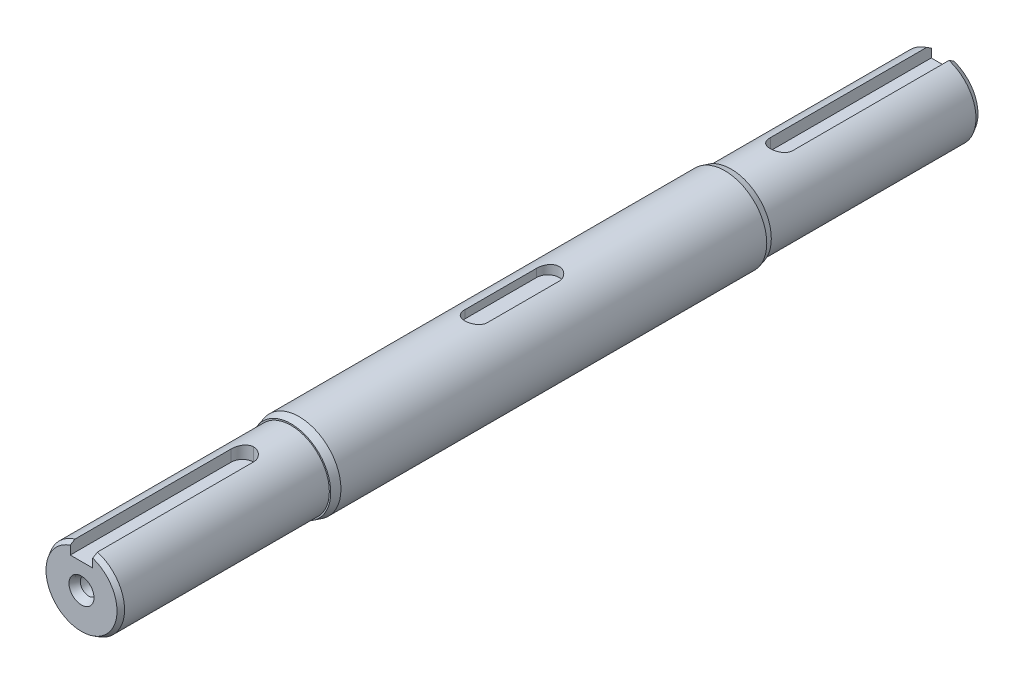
ISO-10303-21;
HEADER;
FILE_DESCRIPTION(('STEP AP214'),'2;1');
FILE_NAME('part.step','',(''),(''),'','','');
FILE_SCHEMA(('AUTOMOTIVE_DESIGN { 1 0 10303 214 1 1 1 1 }'));
ENDSEC;
DATA;
#1=APPLICATION_CONTEXT('core data for automotive mechanical design processes');
#2=APPLICATION_PROTOCOL_DEFINITION('international standard','automotive_design',2000,#1);
#3=PRODUCT_CONTEXT('',#1,'mechanical');
#4=PRODUCT('Part','Part','',(#3));
#5=PRODUCT_RELATED_PRODUCT_CATEGORY('part','',(#4));
#6=PRODUCT_DEFINITION_FORMATION('','',#4);
#7=PRODUCT_DEFINITION_CONTEXT('part definition',#1,'design');
#8=PRODUCT_DEFINITION('design','',#6,#7);
#9=PRODUCT_DEFINITION_SHAPE('','',#8);
#10=(LENGTH_UNIT() NAMED_UNIT(*) SI_UNIT(.MILLI.,.METRE.));
#11=(NAMED_UNIT(*) PLANE_ANGLE_UNIT() SI_UNIT($,.RADIAN.));
#12=(NAMED_UNIT(*) SI_UNIT($,.STERADIAN.) SOLID_ANGLE_UNIT());
#13=UNCERTAINTY_MEASURE_WITH_UNIT(LENGTH_MEASURE(1.E-05),#10,'distance_accuracy_value','');
#14=(GEOMETRIC_REPRESENTATION_CONTEXT(3) GLOBAL_UNCERTAINTY_ASSIGNED_CONTEXT((#13)) GLOBAL_UNIT_ASSIGNED_CONTEXT((#10,
#11,#12)) REPRESENTATION_CONTEXT('',''));
#15=CARTESIAN_POINT('',(0.,0.,0.));
#16=DIRECTION('',(0.,0.,1.));
#17=DIRECTION('',(1.,0.,0.));
#18=AXIS2_PLACEMENT_3D('',#15,#16,#17);
#19=CARTESIAN_POINT('',(0.,0.,90.));
#20=DIRECTION('',(0.,0.,1.));
#21=DIRECTION('',(1.00000000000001,0.,0.));
#22=AXIS2_PLACEMENT_3D('',#19,#20,#21);
#23=CYLINDRICAL_SURFACE('',#22,8.75);
#24=CARTESIAN_POINT('',(0.,0.,44.510288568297));
#25=DIRECTION('',(0.,0.,1.));
#26=DIRECTION('',(1.00000000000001,0.,0.));
#27=AXIS2_PLACEMENT_3D('',#24,#25,#26);
#28=CIRCLE('',#27,8.75);
#29=CARTESIAN_POINT('',(-8.7500000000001,0.,44.510288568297));
#30=VERTEX_POINT('',#29);
#31=EDGE_CURVE('E231',#30,#30,#28,.T.);
#32=ORIENTED_EDGE('',*,*,#31,.F.);
#33=EDGE_LOOP('',(#32));
#34=FACE_BOUND('',#33,.T.);
#35=CARTESIAN_POINT('',(0.,0.,-44.5102885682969));
#36=DIRECTION('',(0.,0.,1.));
#37=DIRECTION('',(1.00000000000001,0.,0.));
#38=AXIS2_PLACEMENT_3D('',#35,#36,#37);
#39=CIRCLE('',#38,8.75);
#40=CARTESIAN_POINT('',(8.75000000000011,0.,-44.5102885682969));
#41=VERTEX_POINT('',#40);
#42=EDGE_CURVE('E228',#41,#41,#39,.T.);
#43=ORIENTED_EDGE('',*,*,#42,.T.);
#44=EDGE_LOOP('',(#43));
#45=FACE_BOUND('',#44,.T.);
#46=CARTESIAN_POINT('',(2.35000000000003,8.42852300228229,-7.50000000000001));
#47=CARTESIAN_POINT('',(2.3500077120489,8.42851511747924,-7.56481720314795));
#48=CARTESIAN_POINT('',(2.34731846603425,8.42927051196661,-7.62962970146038));
#49=CARTESIAN_POINT('',(2.33660599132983,8.43224933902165,-7.75876659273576));
#50=CARTESIAN_POINT('',(2.3285837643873,8.43447249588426,-7.823091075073));
#51=CARTESIAN_POINT('',(2.30728834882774,8.44032201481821,-7.95065937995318));
#52=CARTESIAN_POINT('',(2.29402659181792,8.44394532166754,-8.01390524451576));
#53=CARTESIAN_POINT('',(2.26237773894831,8.45247973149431,-8.13899526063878));
#54=CARTESIAN_POINT('',(2.24399055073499,8.45739085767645,-8.20083938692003));
#55=CARTESIAN_POINT('',(2.18135092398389,8.47384783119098,-8.38360249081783));
#56=CARTESIAN_POINT('',(2.129596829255,8.4871241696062,-8.501892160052));
#57=CARTESIAN_POINT('',(2.0076925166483,8.51678234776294,-8.72809368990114));
#58=CARTESIAN_POINT('',(1.93753608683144,8.53316523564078,-8.83600202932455));
#59=CARTESIAN_POINT('',(1.77891363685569,8.56765357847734,-9.04115097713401));
#60=CARTESIAN_POINT('',(1.69006718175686,8.58578975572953,-9.13809283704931));
#61=CARTESIAN_POINT('',(1.49740282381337,8.62147716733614,-9.31589543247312));
#62=CARTESIAN_POINT('',(1.39358249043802,8.63902830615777,-9.39675355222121));
#63=CARTESIAN_POINT('',(1.17182881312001,8.67191238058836,-9.54135121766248));
#64=CARTESIAN_POINT('',(1.05369341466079,8.68720460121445,-9.60479099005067));
#65=CARTESIAN_POINT('',(0.807959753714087,8.71349215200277,-9.7107909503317));
#66=CARTESIAN_POINT('',(0.680363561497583,8.72448841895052,-9.75335569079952));
#67=CARTESIAN_POINT('',(0.422467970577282,8.740727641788,-9.81542667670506));
#68=CARTESIAN_POINT('',(0.292300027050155,8.74609819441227,-9.83544512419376));
#69=CARTESIAN_POINT('',(0.0303471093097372,8.7509272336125,-9.85346720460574));
#70=CARTESIAN_POINT('',(-0.101437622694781,8.75038659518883,-9.85147409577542));
#71=CARTESIAN_POINT('',(-0.359310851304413,8.7435472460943,-9.82588860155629));
#72=CARTESIAN_POINT('',(-0.485458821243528,8.7373962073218,-9.80285012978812));
#73=CARTESIAN_POINT('',(-0.732026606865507,8.72020183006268,-9.73672355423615));
#74=CARTESIAN_POINT('',(-0.852446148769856,8.70915825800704,-9.6936344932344));
#75=CARTESIAN_POINT('',(-1.08555024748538,8.68320131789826,-9.58820759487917));
#76=CARTESIAN_POINT('',(-1.19814487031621,8.6682501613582,-9.52568059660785));
#77=CARTESIAN_POINT('',(-1.41142943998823,8.63608807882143,-9.38329905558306));
#78=CARTESIAN_POINT('',(-1.51211726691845,8.61887675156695,-9.30344143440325));
#79=CARTESIAN_POINT('',(-1.70202867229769,8.583427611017,-9.12573945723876));
#80=CARTESIAN_POINT('',(-1.79079960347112,8.56517451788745,-9.02741389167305));
#81=CARTESIAN_POINT('',(-1.95072314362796,8.53017594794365,-8.81705574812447));
#82=CARTESIAN_POINT('',(-2.02187086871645,8.51343088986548,-8.70501938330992));
#83=CARTESIAN_POINT('',(-2.14488641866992,8.48327861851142,-8.46940804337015));
#84=CARTESIAN_POINT('',(-2.19661868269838,8.46989508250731,-8.34575920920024));
#85=CARTESIAN_POINT('',(-2.27834723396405,8.44828094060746,-8.0911402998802));
#86=CARTESIAN_POINT('',(-2.30837619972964,8.4400425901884,-7.96018155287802));
#87=CARTESIAN_POINT('',(-2.33469186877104,8.43277881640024,-7.77337932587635));
#88=CARTESIAN_POINT('',(-2.34043288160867,8.431185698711,-7.71882990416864));
#89=CARTESIAN_POINT('',(-2.34808291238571,8.42905806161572,-7.60952916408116));
#90=CARTESIAN_POINT('',(-2.34999797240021,8.42852187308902,-7.55477830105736));
#91=CARTESIAN_POINT('',(-2.35,8.42852300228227,-7.50000000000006));
#92=B_SPLINE_CURVE_WITH_KNOTS('',3,(#46,#47,#48,#49,#50,#51,#52,#53,#54,#55,#56,#57,#58,#59,#60,
#61,#62,#63,#64,#65,#66,#67,#68,#69,#70,#71,#72,#73,#74,#75,#76,#77,#78,#79,#80,#81,#82,#83,#84,
#85,#86,#87,#88,#89,#90,#91),.UNSPECIFIED.,.F.,.F.,(4,2,2,2,2,2,2,2,2,2,2,2,2,2,2,2,2,2,2,2,2,2,
4),(0.,0.194383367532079,0.388730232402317,0.58265539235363,0.776584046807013,1.16402038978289,
1.55158768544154,1.94797731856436,2.34443136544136,2.74733270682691,3.15014614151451,
3.54361134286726,3.93701830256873,4.32036010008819,4.70372020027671,5.09093437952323,
5.47821739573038,5.87751700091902,6.27692713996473,6.67907629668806,7.08061867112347,
7.24512305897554,7.40936744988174),.UNSPECIFIED.);
#93=CARTESIAN_POINT('',(2.35000000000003,8.42852300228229,-7.50000000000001));
#94=VERTEX_POINT('',#93);
#95=CARTESIAN_POINT('',(-2.35,8.42852300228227,-7.50000000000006));
#96=VERTEX_POINT('',#95);
#97=EDGE_CURVE('E338',#94,#96,#92,.T.);
#98=ORIENTED_EDGE('',*,*,#97,.F.);
#99=DIRECTION('',(0.,0.,1.));
#100=VECTOR('',#99,1.);
#101=CARTESIAN_POINT('',(2.35000000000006,8.42852300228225,90.));
#102=LINE('',#101,#100);
#103=CARTESIAN_POINT('',(2.35000000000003,8.42852300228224,7.49999999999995));
#104=VERTEX_POINT('',#103);
#105=EDGE_CURVE('E11',#104,#94,#102,.F.);
#106=ORIENTED_EDGE('',*,*,#105,.F.);
#107=CARTESIAN_POINT('',(-2.35,8.42852300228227,7.49999999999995));
#108=CARTESIAN_POINT('',(-2.35000771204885,8.42851511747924,7.56481720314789));
#109=CARTESIAN_POINT('',(-2.34731846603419,8.42927051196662,7.6296297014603));
#110=CARTESIAN_POINT('',(-2.33660599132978,8.43224933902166,7.75876659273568));
#111=CARTESIAN_POINT('',(-2.32858376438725,8.43447249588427,7.82309107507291));
#112=CARTESIAN_POINT('',(-2.3072883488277,8.44032201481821,7.95065937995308));
#113=CARTESIAN_POINT('',(-2.29402659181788,8.44394532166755,8.01390524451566));
#114=CARTESIAN_POINT('',(-2.26237773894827,8.4524797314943,8.13899526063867));
#115=CARTESIAN_POINT('',(-2.24399055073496,8.45739085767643,8.20083938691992));
#116=CARTESIAN_POINT('',(-2.18135092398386,8.47384783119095,8.38360249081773));
#117=CARTESIAN_POINT('',(-2.12959682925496,8.48712416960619,8.5018921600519));
#118=CARTESIAN_POINT('',(-2.00769251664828,8.51678234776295,8.72809368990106));
#119=CARTESIAN_POINT('',(-1.93753608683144,8.53316523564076,8.83600202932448));
#120=CARTESIAN_POINT('',(-1.7789136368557,8.56765357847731,9.04115097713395));
#121=CARTESIAN_POINT('',(-1.69006718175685,8.58578975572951,9.13809283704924));
#122=CARTESIAN_POINT('',(-1.49740282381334,8.62147716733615,9.31589543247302));
#123=CARTESIAN_POINT('',(-1.39358249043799,8.63902830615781,9.39675355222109));
#124=CARTESIAN_POINT('',(-1.17182881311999,8.67191238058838,9.54135121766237));
#125=CARTESIAN_POINT('',(-1.05369341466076,8.68720460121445,9.60479099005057));
#126=CARTESIAN_POINT('',(-0.807959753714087,8.71349215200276,9.71079095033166));
#127=CARTESIAN_POINT('',(-0.680363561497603,8.72448841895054,9.75335569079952));
#128=CARTESIAN_POINT('',(-0.422467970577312,8.74072764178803,9.81542667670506));
#129=CARTESIAN_POINT('',(-0.292300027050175,8.74609819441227,9.83544512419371));
#130=CARTESIAN_POINT('',(-0.0303471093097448,8.75092723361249,9.85346720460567));
#131=CARTESIAN_POINT('',(0.101437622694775,8.75038659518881,9.85147409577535));
#132=CARTESIAN_POINT('',(0.359310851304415,8.74354724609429,9.82588860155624));
#133=CARTESIAN_POINT('',(0.485458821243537,8.7373962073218,9.80285012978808));
#134=CARTESIAN_POINT('',(0.732026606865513,8.72020183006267,9.7367235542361));
#135=CARTESIAN_POINT('',(0.852446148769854,8.70915825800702,9.69363449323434));
#136=CARTESIAN_POINT('',(1.08555024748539,8.68320131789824,9.58820759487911));
#137=CARTESIAN_POINT('',(1.19814487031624,8.66825016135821,9.52568059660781));
#138=CARTESIAN_POINT('',(1.41142943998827,8.63608807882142,9.38329905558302));
#139=CARTESIAN_POINT('',(1.51211726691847,8.6188767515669,9.3034414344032));
#140=CARTESIAN_POINT('',(1.70202867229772,8.58342761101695,9.12573945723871));
#141=CARTESIAN_POINT('',(1.79079960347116,8.56517451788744,9.02741389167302));
#142=CARTESIAN_POINT('',(1.95072314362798,8.53017594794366,8.81705574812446));
#143=CARTESIAN_POINT('',(2.02187086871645,8.51343088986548,8.70501938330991));
#144=CARTESIAN_POINT('',(2.14488641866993,8.4832786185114,8.46940804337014));
#145=CARTESIAN_POINT('',(2.19661868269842,8.46989508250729,8.34575920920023));
#146=CARTESIAN_POINT('',(2.27834723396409,8.44828094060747,8.09114029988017));
#147=CARTESIAN_POINT('',(2.30837619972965,8.44004259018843,7.96018155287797));
#148=CARTESIAN_POINT('',(2.33469186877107,8.43277881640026,7.77337932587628));
#149=CARTESIAN_POINT('',(2.34043288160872,8.431185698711,7.71882990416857));
#150=CARTESIAN_POINT('',(2.34808291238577,8.4290580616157,7.60952916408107));
#151=CARTESIAN_POINT('',(2.34999797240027,8.42852187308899,7.55477830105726));
#152=CARTESIAN_POINT('',(2.35000000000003,8.42852300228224,7.49999999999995));
#153=B_SPLINE_CURVE_WITH_KNOTS('',3,(#107,#108,#109,#110,#111,#112,#113,#114,#115,#116,#117,
#118,#119,#120,#121,#122,#123,#124,#125,#126,#127,#128,#129,#130,#131,#132,#133,#134,#135,#136,
#137,#138,#139,#140,#141,#142,#143,#144,#145,#146,#147,#148,#149,#150,#151,#152),.UNSPECIFIED.,
.F.,.F.,(4,2,2,2,2,2,2,2,2,2,2,2,2,2,2,2,2,2,2,2,2,2,4),(0.,0.194383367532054,0.388730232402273,
0.582655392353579,0.776584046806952,1.16402038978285,1.55158768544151,1.94797731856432,
2.34443136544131,2.74733270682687,3.15014614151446,3.54361134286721,3.93701830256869,
4.32036010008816,4.70372020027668,5.09093437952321,5.47821739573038,5.87751700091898,
6.27692713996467,6.67907629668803,7.08061867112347,7.24512305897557,7.4093674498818),.UNSPECIFIED.);
#154=CARTESIAN_POINT('',(-2.35,8.42852300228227,7.49999999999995));
#155=VERTEX_POINT('',#154);
#156=EDGE_CURVE('E156',#155,#104,#153,.T.);
#157=ORIENTED_EDGE('',*,*,#156,.F.);
#158=DIRECTION('',(0.,0.,1.));
#159=VECTOR('',#158,1.);
#160=CARTESIAN_POINT('',(-2.35,8.42852300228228,90.));
#161=LINE('',#160,#159);
#162=EDGE_CURVE('E44',#96,#155,#161,.T.);
#163=ORIENTED_EDGE('',*,*,#162,.F.);
#164=EDGE_LOOP('',(#98,#106,#157,#163));
#165=FACE_BOUND('',#164,.T.);
#166=ADVANCED_FACE('F36',(#34,#45,#165),#23,.T.);
#167=CARTESIAN_POINT('',(0.,8.00000000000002,-89.9999999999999));
#168=DIRECTION('',(0.,0.,1.));
#169=DIRECTION('',(1.00000000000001,0.,0.));
#170=AXIS2_PLACEMENT_3D('',#167,#168,#169);
#171=PLANE('',#170);
#172=CARTESIAN_POINT('',(0.,0.,-89.9999999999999));
#173=DIRECTION('',(0.,0.,1.));
#174=DIRECTION('',(1.00000000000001,0.,0.));
#175=AXIS2_PLACEMENT_3D('',#172,#173,#174);
#176=CIRCLE('',#175,2.61602540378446);
#177=CARTESIAN_POINT('',(-2.61602540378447,0.,-89.9999999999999));
#178=VERTEX_POINT('',#177);
#179=EDGE_CURVE('E303',#178,#178,#176,.T.);
#180=ORIENTED_EDGE('',*,*,#179,.T.);
#181=EDGE_LOOP('',(#180));
#182=FACE_BOUND('',#181,.T.);
#183=DIRECTION('',(0.,-1.00000000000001,0.));
#184=VECTOR('',#183,1.);
#185=CARTESIAN_POINT('',(-2.35000000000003,7.64705825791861,-89.9999999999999));
#186=LINE('',#185,#184);
#187=CARTESIAN_POINT('',(-2.34999999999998,7.04082587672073,-89.9999999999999));
#188=VERTEX_POINT('',#187);
#189=CARTESIAN_POINT('',(-2.35000000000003,5.24705825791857,-89.9999999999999));
#190=VERTEX_POINT('',#189);
#191=EDGE_CURVE('E191',#188,#190,#186,.T.);
#192=ORIENTED_EDGE('',*,*,#191,.T.);
#193=DIRECTION('',(1.00000000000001,0.,0.));
#194=VECTOR('',#193,1.);
#195=CARTESIAN_POINT('',(-2.35000000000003,5.24705825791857,-89.9999999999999));
#196=LINE('',#195,#194);
#197=CARTESIAN_POINT('',(2.35000000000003,5.24705825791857,-89.9999999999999));
#198=VERTEX_POINT('',#197);
#199=EDGE_CURVE('E188',#190,#198,#196,.T.);
#200=ORIENTED_EDGE('',*,*,#199,.T.);
#201=DIRECTION('',(0.,1.00000000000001,0.));
#202=VECTOR('',#201,1.);
#203=CARTESIAN_POINT('',(2.35000000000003,5.24705825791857,-89.9999999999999));
#204=LINE('',#203,#202);
#205=CARTESIAN_POINT('',(2.35,7.04082587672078,-89.9999999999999));
#206=VERTEX_POINT('',#205);
#207=EDGE_CURVE('E185',#198,#206,#204,.T.);
#208=ORIENTED_EDGE('',*,*,#207,.T.);
#209=CARTESIAN_POINT('',(0.,0.,-89.9999999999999));
#210=DIRECTION('',(0.,0.,1.));
#211=DIRECTION('',(1.00000000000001,0.,0.));
#212=AXIS2_PLACEMENT_3D('',#209,#210,#211);
#213=CIRCLE('',#212,7.42264973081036);
#214=EDGE_CURVE('E249',#206,#188,#213,.F.);
#215=ORIENTED_EDGE('',*,*,#214,.T.);
#216=EDGE_LOOP('',(#192,#200,#208,#215));
#217=FACE_BOUND('',#216,.T.);
#218=ADVANCED_FACE('F277',(#182,#217),#171,.F.);
#219=CARTESIAN_POINT('',(0.,0.,90.));
#220=DIRECTION('',(0.,0.,1.));
#221=DIRECTION('',(1.00000000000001,0.,0.));
#222=AXIS2_PLACEMENT_3D('',#219,#220,#221);
#223=CYLINDRICAL_SURFACE('',#222,8.);
#224=CARTESIAN_POINT('',(0.,0.,-45.8102885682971));
#225=DIRECTION('',(0.,0.,1.));
#226=DIRECTION('',(1.00000000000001,0.,0.));
#227=AXIS2_PLACEMENT_3D('',#224,#225,#226);
#228=CIRCLE('',#227,8.);
#229=CARTESIAN_POINT('',(8.00000000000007,0.,-45.8102885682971));
#230=VERTEX_POINT('',#229);
#231=EDGE_CURVE('E217',#230,#230,#228,.T.);
#232=ORIENTED_EDGE('',*,*,#231,.F.);
#233=EDGE_LOOP('',(#232));
#234=FACE_BOUND('',#233,.T.);
#235=CARTESIAN_POINT('',(2.35000000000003,7.64705825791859,-56.3499999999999));
#236=CARTESIAN_POINT('',(2.3500079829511,7.64704949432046,-56.2854348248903));
#237=CARTESIAN_POINT('',(2.34733930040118,7.64787575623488,-56.2208747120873));
#238=CARTESIAN_POINT('',(2.33671069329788,7.65113322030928,-56.092245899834));
#239=CARTESIAN_POINT('',(2.32875191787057,7.65356407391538,-56.028177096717));
#240=CARTESIAN_POINT('',(2.3076318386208,7.6599575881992,-55.9011441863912));
#241=CARTESIAN_POINT('',(2.29448371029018,7.66391636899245,-55.8381777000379));
#242=CARTESIAN_POINT('',(2.26311306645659,7.67323824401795,-55.7136447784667));
#243=CARTESIAN_POINT('',(2.24489042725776,7.67860137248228,-55.6520783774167));
#244=CARTESIAN_POINT('',(2.18283045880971,7.69656610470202,-55.4701546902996));
#245=CARTESIAN_POINT('',(2.13157510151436,7.71105142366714,-55.3524183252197));
#246=CARTESIAN_POINT('',(2.01088453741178,7.74339868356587,-55.1272149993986));
#247=CARTESIAN_POINT('',(1.94144075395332,7.7612622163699,-55.0197529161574));
#248=CARTESIAN_POINT('',(1.78409455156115,7.79895599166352,-54.8148678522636));
#249=CARTESIAN_POINT('',(1.69574045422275,7.81882657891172,-54.7177985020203));
#250=CARTESIAN_POINT('',(1.50404298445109,7.85795197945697,-54.5396173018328));
#251=CARTESIAN_POINT('',(1.40069670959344,7.87720667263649,-54.4585085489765));
#252=CARTESIAN_POINT('',(1.1794077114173,7.91339387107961,-54.3129970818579));
#253=CARTESIAN_POINT('',(1.06121391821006,7.93027208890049,-54.2489618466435));
#254=CARTESIAN_POINT('',(0.81519127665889,7.95931895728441,-54.1418498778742));
#255=CARTESIAN_POINT('',(0.687370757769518,7.97149162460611,-54.0987552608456));
#256=CARTESIAN_POINT('',(0.465769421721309,7.98694984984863,-54.0447180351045));
#257=CARTESIAN_POINT('',(0.373470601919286,7.99181272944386,-54.0279814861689));
#258=CARTESIAN_POINT('',(0.187465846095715,7.99835144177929,-54.0056119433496));
#259=CARTESIAN_POINT('',(0.0937604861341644,8.00002854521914,-53.999974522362));
#260=CARTESIAN_POINT('',(0.,8.00000000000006,-54.0000000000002));
#261=B_SPLINE_CURVE_WITH_KNOTS('',3,(#235,#236,#237,#238,#239,#240,#241,#242,#243,#244,#245,
#246,#247,#248,#249,#250,#251,#252,#253,#254,#255,#256,#257,#258,#259,#260),.UNSPECIFIED.,.F.,
.F.,(4,2,2,2,2,2,2,2,2,2,2,2,4),(0.,0.19362647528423,0.387210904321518,0.580306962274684,
0.773407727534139,1.15914422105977,1.54506293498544,1.94150442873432,2.3380227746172,
2.74248966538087,3.14661052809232,3.42771778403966,3.70871289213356),.UNSPECIFIED.);
#262=CARTESIAN_POINT('',(2.35000000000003,7.64705825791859,-56.3499999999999));
#263=VERTEX_POINT('',#262);
#264=CARTESIAN_POINT('',(0.,8.00000000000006,-54.0000000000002));
#265=VERTEX_POINT('',#264);
#266=EDGE_CURVE('E59',#263,#265,#261,.T.);
#267=ORIENTED_EDGE('',*,*,#266,.T.);
#268=CARTESIAN_POINT('',(0.,8.00000000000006,-54.0000000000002));
#269=CARTESIAN_POINT('',(-0.0646260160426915,8.00000739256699,-53.9999921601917));
#270=CARTESIAN_POINT('',(-0.129247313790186,7.99921707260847,-54.0026657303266));
#271=CARTESIAN_POINT('',(-0.258001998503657,7.99609592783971,-54.0133148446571));
#272=CARTESIAN_POINT('',(-0.322135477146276,7.99376540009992,-54.0212893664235));
#273=CARTESIAN_POINT('',(-0.449310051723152,7.98762602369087,-54.0424544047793));
#274=CARTESIAN_POINT('',(-0.51235338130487,7.98382070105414,-54.0556324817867));
#275=CARTESIAN_POINT('',(-0.637041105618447,7.97484128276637,-54.0870774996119));
#276=CARTESIAN_POINT('',(-0.698685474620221,7.96966716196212,-54.1053445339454));
#277=CARTESIAN_POINT('',(-0.880854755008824,7.95228947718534,-54.1675654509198));
#278=CARTESIAN_POINT('',(-0.998756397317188,7.938223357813,-54.2189627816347));
#279=CARTESIAN_POINT('',(-1.22423517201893,7.90659625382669,-54.339985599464));
#280=CARTESIAN_POINT('',(-1.33180813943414,7.88903386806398,-54.4096183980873));
#281=CARTESIAN_POINT('',(-1.53657884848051,7.85175272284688,-54.5671618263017));
#282=CARTESIAN_POINT('',(-1.63345475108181,7.83199142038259,-54.6554813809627));
#283=CARTESIAN_POINT('',(-1.81125990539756,7.79279468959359,-54.8470288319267));
#284=CARTESIAN_POINT('',(-1.89218509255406,7.77335934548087,-54.9502605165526));
#285=CARTESIAN_POINT('',(-2.03749022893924,7.73656184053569,-55.1714338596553));
#286=CARTESIAN_POINT('',(-2.10147256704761,7.71925388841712,-55.289646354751));
#287=CARTESIAN_POINT('',(-2.20847932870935,7.6893253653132,-55.5357030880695));
#288=CARTESIAN_POINT('',(-2.25152307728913,7.6767004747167,-55.663538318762));
#289=CARTESIAN_POINT('',(-2.3054306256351,7.66064826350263,-55.8850030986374));
#290=CARTESIAN_POINT('',(-2.32210975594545,7.6555889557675,-55.9771393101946));
#291=CARTESIAN_POINT('',(-2.3444057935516,7.64877750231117,-56.1628315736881));
#292=CARTESIAN_POINT('',(-2.3500258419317,7.64702441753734,-56.2563872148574));
#293=CARTESIAN_POINT('',(-2.35000000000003,7.64705825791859,-56.35));
#294=B_SPLINE_CURVE_WITH_KNOTS('',3,(#268,#269,#270,#271,#272,#273,#274,#275,#276,#277,#278,
#279,#280,#281,#282,#283,#284,#285,#286,#287,#288,#289,#290,#291,#292,#293),.UNSPECIFIED.,.F.,
.F.,(4,2,2,2,2,2,2,2,2,2,2,2,4),(0.,0.19380984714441,0.387582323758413,0.580894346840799,
0.774209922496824,1.16041831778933,1.54678180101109,1.94268702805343,2.33869300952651,
2.7433016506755,3.14753615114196,3.42816403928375,3.70871220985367),.UNSPECIFIED.);
#295=CARTESIAN_POINT('',(-2.35000000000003,7.64705825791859,-56.35));
#296=VERTEX_POINT('',#295);
#297=EDGE_CURVE('E297',#265,#296,#294,.T.);
#298=ORIENTED_EDGE('',*,*,#297,.T.);
#299=DIRECTION('',(0.,0.,-1.));
#300=VECTOR('',#299,1.);
#301=CARTESIAN_POINT('',(-2.35,7.64705825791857,-54.0000000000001));
#302=LINE('',#301,#300);
#303=CARTESIAN_POINT('',(-2.35000000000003,7.64705825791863,-89.0000000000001));
#304=VERTEX_POINT('',#303);
#305=EDGE_CURVE('E195',#296,#304,#302,.T.);
#306=ORIENTED_EDGE('',*,*,#305,.T.);
#307=CARTESIAN_POINT('',(0.,0.,-89.));
#308=DIRECTION('',(0.,0.,1.));
#309=DIRECTION('',(1.00000000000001,0.,0.));
#310=AXIS2_PLACEMENT_3D('',#307,#308,#309);
#311=CIRCLE('',#310,8.);
#312=CARTESIAN_POINT('',(2.35000000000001,7.64705825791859,-89.));
#313=VERTEX_POINT('',#312);
#314=EDGE_CURVE('E246',#304,#313,#311,.T.);
#315=ORIENTED_EDGE('',*,*,#314,.T.);
#316=DIRECTION('',(0.,0.,-1.));
#317=VECTOR('',#316,1.);
#318=CARTESIAN_POINT('',(2.35000000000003,7.64705825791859,-54.));
#319=LINE('',#318,#317);
#320=EDGE_CURVE('E194',#263,#313,#319,.T.);
#321=ORIENTED_EDGE('',*,*,#320,.F.);
#322=EDGE_LOOP('',(#267,#298,#306,#315,#321));
#323=FACE_BOUND('',#322,.T.);
#324=ADVANCED_FACE('F280',(#234,#323),#223,.T.);
#325=CARTESIAN_POINT('',(0.,0.,-89.));
#326=DIRECTION('',(0.,0.,1.));
#327=DIRECTION('',(1.00000000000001,0.,0.));
#328=AXIS2_PLACEMENT_3D('',#325,#326,#327);
#329=CONICAL_SURFACE('',#328,8.,0.523598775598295);
#330=ORIENTED_EDGE('',*,*,#314,.F.);
#331=CARTESIAN_POINT('',(-2.35000000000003,9.75475431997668,-85.4773041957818));
#332=CARTESIAN_POINT('',(-2.35000000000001,9.53285442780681,-85.8509367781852));
#333=CARTESIAN_POINT('',(-2.35,9.31066357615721,-86.2243970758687));
#334=CARTESIAN_POINT('',(-2.35,8.86552249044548,-86.9708633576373));
#335=CARTESIAN_POINT('',(-2.35,8.6425722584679,-87.3438693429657));
#336=CARTESIAN_POINT('',(-2.35,8.195756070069,-88.0892820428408));
#337=CARTESIAN_POINT('',(-2.35,7.97189020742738,-88.4616888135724));
#338=CARTESIAN_POINT('',(-2.35,7.52296015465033,-89.205782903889));
#339=CARTESIAN_POINT('',(-2.35,7.29789595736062,-89.5774702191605));
#340=CARTESIAN_POINT('',(-2.35,6.84618591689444,-90.3199372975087));
#341=CARTESIAN_POINT('',(-2.35,6.61953990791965,-90.690716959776));
#342=CARTESIAN_POINT('',(-2.35,6.16417409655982,-91.4309952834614));
#343=CARTESIAN_POINT('',(-2.35,5.9354543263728,-91.8004939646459));
#344=CARTESIAN_POINT('',(-2.35,5.59020212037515,-92.353413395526));
#345=CARTESIAN_POINT('',(-2.35,5.47474962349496,-92.5375084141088));
#346=CARTESIAN_POINT('',(-2.35,5.24297865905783,-92.9051516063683));
#347=CARTESIAN_POINT('',(-2.35,5.12666019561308,-93.0886997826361));
#348=CARTESIAN_POINT('',(-2.35,4.89297728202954,-93.4551432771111));
#349=CARTESIAN_POINT('',(-2.35,4.77561277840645,-93.6380385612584));
#350=CARTESIAN_POINT('',(-2.35,4.53959196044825,-94.0029975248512));
#351=CARTESIAN_POINT('',(-2.35,4.42093562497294,-94.1850611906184));
#352=CARTESIAN_POINT('',(-2.35,4.30150942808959,-94.3666214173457));
#353=B_SPLINE_CURVE_WITH_KNOTS('',3,(#331,#332,#333,#334,#335,#336,#337,#338,#339,#340,#341,
#342,#343,#344,#345,#346,#347,#348,#349,#350,#351,#352),.UNSPECIFIED.,.F.,.F.,(4,2,2,2,2,2,2,2,
2,2,4),(0.,1.30367527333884,2.60734697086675,3.91088833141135,5.21443748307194,6.51812538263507,
7.82179307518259,8.47369781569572,9.12559946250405,9.77753463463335,10.4294804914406),.UNSPECIFIED.);
#354=EDGE_CURVE('E370',#304,#188,#353,.T.);
#355=ORIENTED_EDGE('',*,*,#354,.T.);
#356=ORIENTED_EDGE('',*,*,#214,.F.);
#357=CARTESIAN_POINT('',(2.35,4.30150942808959,-94.3666214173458));
#358=CARTESIAN_POINT('',(2.35000000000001,4.42093562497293,-94.1850611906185));
#359=CARTESIAN_POINT('',(2.35000000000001,4.53959196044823,-94.0029975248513));
#360=CARTESIAN_POINT('',(2.35000000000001,4.77561277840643,-93.6380385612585));
#361=CARTESIAN_POINT('',(2.35000000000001,4.89297728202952,-93.4551432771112));
#362=CARTESIAN_POINT('',(2.35000000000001,5.12666019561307,-93.0886997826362));
#363=CARTESIAN_POINT('',(2.35000000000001,5.24297865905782,-92.9051516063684));
#364=CARTESIAN_POINT('',(2.35000000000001,5.47474962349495,-92.5375084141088));
#365=CARTESIAN_POINT('',(2.35000000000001,5.59020212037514,-92.353413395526));
#366=CARTESIAN_POINT('',(2.35000000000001,5.9354543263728,-91.8004939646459));
#367=CARTESIAN_POINT('',(2.35,6.16417409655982,-91.4309952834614));
#368=CARTESIAN_POINT('',(2.35000000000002,6.61953990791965,-90.690716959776));
#369=CARTESIAN_POINT('',(2.35000000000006,6.84618591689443,-90.3199372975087));
#370=CARTESIAN_POINT('',(2.35000000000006,7.29789595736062,-89.5774702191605));
#371=CARTESIAN_POINT('',(2.35000000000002,7.52296015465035,-89.2057829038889));
#372=CARTESIAN_POINT('',(2.35,7.97189020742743,-88.4616888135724));
#373=CARTESIAN_POINT('',(2.35000000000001,8.19575607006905,-88.0892820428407));
#374=CARTESIAN_POINT('',(2.35000000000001,8.64257225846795,-87.3438693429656));
#375=CARTESIAN_POINT('',(2.35000000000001,8.86552249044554,-86.9708633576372));
#376=CARTESIAN_POINT('',(2.35000000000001,9.31066357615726,-86.2243970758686));
#377=CARTESIAN_POINT('',(2.35000000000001,9.53285442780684,-85.8509367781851));
#378=CARTESIAN_POINT('',(2.35000000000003,9.75475431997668,-85.4773041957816));
#379=B_SPLINE_CURVE_WITH_KNOTS('',3,(#357,#358,#359,#360,#361,#362,#363,#364,#365,#366,#367,
#368,#369,#370,#371,#372,#373,#374,#375,#376,#377,#378),.UNSPECIFIED.,.F.,.F.,(4,2,2,2,2,2,2,2,
2,2,4),(0.,0.651945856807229,1.30388102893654,1.9557826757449,2.60768741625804,3.91135510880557,
5.21504300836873,6.51859216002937,7.822133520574,9.12580521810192,10.4294804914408),.UNSPECIFIED.);
#380=EDGE_CURVE('E378',#206,#313,#379,.T.);
#381=ORIENTED_EDGE('',*,*,#380,.T.);
#382=EDGE_LOOP('',(#330,#355,#356,#381));
#383=FACE_BOUND('',#382,.T.);
#384=ADVANCED_FACE('F285',(#383),#329,.T.);
#385=CARTESIAN_POINT('',(0.,0.,90.));
#386=DIRECTION('',(0.,0.,-1.));
#387=DIRECTION('',(-1.00000000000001,0.,0.));
#388=AXIS2_PLACEMENT_3D('',#385,#386,#387);
#389=PLANE('',#388);
#390=CARTESIAN_POINT('',(0.,0.,90.));
#391=DIRECTION('',(0.,0.,-1.));
#392=DIRECTION('',(-1.00000000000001,0.,0.));
#393=AXIS2_PLACEMENT_3D('',#390,#391,#392);
#394=CIRCLE('',#393,2.61602540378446);
#395=CARTESIAN_POINT('',(2.61602540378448,0.,90.));
#396=VERTEX_POINT('',#395);
#397=EDGE_CURVE('E422',#396,#396,#394,.T.);
#398=ORIENTED_EDGE('',*,*,#397,.T.);
#399=EDGE_LOOP('',(#398));
#400=FACE_BOUND('',#399,.T.);
#401=CARTESIAN_POINT('',(0.,0.,90.));
#402=DIRECTION('',(0.,0.,-1.));
#403=DIRECTION('',(-1.00000000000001,0.,0.));
#404=AXIS2_PLACEMENT_3D('',#401,#402,#403);
#405=CIRCLE('',#404,7.42264973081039);
#406=CARTESIAN_POINT('',(-2.35,7.04082587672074,90.));
#407=VERTEX_POINT('',#406);
#408=CARTESIAN_POINT('',(2.35000000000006,7.04082587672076,90.));
#409=VERTEX_POINT('',#408);
#410=EDGE_CURVE('E240',#407,#409,#405,.F.);
#411=ORIENTED_EDGE('',*,*,#410,.T.);
#412=DIRECTION('',(0.,1.00000000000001,0.));
#413=VECTOR('',#412,1.);
#414=CARTESIAN_POINT('',(2.35000000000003,5.24705825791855,90.));
#415=LINE('',#414,#413);
#416=CARTESIAN_POINT('',(2.35000000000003,5.24705825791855,90.));
#417=VERTEX_POINT('',#416);
#418=EDGE_CURVE('E212',#417,#409,#415,.T.);
#419=ORIENTED_EDGE('',*,*,#418,.F.);
#420=DIRECTION('',(1.00000000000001,0.,0.));
#421=VECTOR('',#420,1.);
#422=CARTESIAN_POINT('',(-2.35,5.24705825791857,89.9999999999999));
#423=LINE('',#422,#421);
#424=CARTESIAN_POINT('',(-2.35,5.24705825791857,89.9999999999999));
#425=VERTEX_POINT('',#424);
#426=EDGE_CURVE('E209',#425,#417,#423,.T.);
#427=ORIENTED_EDGE('',*,*,#426,.F.);
#428=DIRECTION('',(0.,-1.00000000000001,0.));
#429=VECTOR('',#428,1.);
#430=CARTESIAN_POINT('',(-2.35000000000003,7.64705825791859,90.));
#431=LINE('',#430,#429);
#432=EDGE_CURVE('E206',#407,#425,#431,.T.);
#433=ORIENTED_EDGE('',*,*,#432,.F.);
#434=EDGE_LOOP('',(#411,#419,#427,#433));
#435=FACE_BOUND('',#434,.T.);
#436=ADVANCED_FACE('F387',(#400,#435),#389,.F.);
#437=CARTESIAN_POINT('',(0.,0.,90.));
#438=DIRECTION('',(0.,0.,1.));
#439=DIRECTION('',(1.00000000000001,0.,0.));
#440=AXIS2_PLACEMENT_3D('',#437,#438,#439);
#441=CYLINDRICAL_SURFACE('',#440,7.99999999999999);
#442=DIRECTION('',(0.,0.,1.));
#443=VECTOR('',#442,1.);
#444=CARTESIAN_POINT('',(-2.35,7.64705825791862,53.9999999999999));
#445=LINE('',#444,#443);
#446=CARTESIAN_POINT('',(-2.35,7.64705825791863,56.35));
#447=VERTEX_POINT('',#446);
#448=CARTESIAN_POINT('',(-2.35,7.64705825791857,89.));
#449=VERTEX_POINT('',#448);
#450=EDGE_CURVE('E214',#447,#449,#445,.T.);
#451=ORIENTED_EDGE('',*,*,#450,.F.);
#452=CARTESIAN_POINT('',(-2.35,7.64705825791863,56.35));
#453=CARTESIAN_POINT('',(-2.35000798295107,7.64704949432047,56.2854348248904));
#454=CARTESIAN_POINT('',(-2.34733930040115,7.64787575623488,56.2208747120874));
#455=CARTESIAN_POINT('',(-2.33671069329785,7.65113322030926,56.0922458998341));
#456=CARTESIAN_POINT('',(-2.32875191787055,7.65356407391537,56.028177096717));
#457=CARTESIAN_POINT('',(-2.30763183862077,7.65995758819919,55.9011441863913));
#458=CARTESIAN_POINT('',(-2.29448371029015,7.66391636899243,55.8381777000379));
#459=CARTESIAN_POINT('',(-2.26311306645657,7.67323824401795,55.7136447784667));
#460=CARTESIAN_POINT('',(-2.24489042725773,7.67860137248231,55.6520783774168));
#461=CARTESIAN_POINT('',(-2.18283045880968,7.69656610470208,55.4701546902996));
#462=CARTESIAN_POINT('',(-2.1315751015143,7.71105142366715,55.3524183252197));
#463=CARTESIAN_POINT('',(-2.01088453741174,7.74339868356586,55.1272149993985));
#464=CARTESIAN_POINT('',(-1.9414407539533,7.7612622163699,55.0197529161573));
#465=CARTESIAN_POINT('',(-1.78409455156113,7.79895599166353,54.8148678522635));
#466=CARTESIAN_POINT('',(-1.69574045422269,7.81882657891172,54.7177985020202));
#467=CARTESIAN_POINT('',(-1.50404298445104,7.85795197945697,54.5396173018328));
#468=CARTESIAN_POINT('',(-1.40069670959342,7.87720667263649,54.4585085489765));
#469=CARTESIAN_POINT('',(-1.1794077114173,7.91339387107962,54.3129970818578));
#470=CARTESIAN_POINT('',(-1.06121391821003,7.93027208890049,54.2489618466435));
#471=CARTESIAN_POINT('',(-0.815191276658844,7.9593189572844,54.1418498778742));
#472=CARTESIAN_POINT('',(-0.687370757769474,7.9714916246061,54.0987552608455));
#473=CARTESIAN_POINT('',(-0.465769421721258,7.98694984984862,54.0447180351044));
#474=CARTESIAN_POINT('',(-0.373470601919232,7.99181272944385,54.0279814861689));
#475=CARTESIAN_POINT('',(-0.187465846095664,7.99835144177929,54.0056119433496));
#476=CARTESIAN_POINT('',(-0.0937604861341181,8.00002854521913,53.9999745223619));
#477=CARTESIAN_POINT('',(0.,8.00000000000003,53.9999999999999));
#478=B_SPLINE_CURVE_WITH_KNOTS('',3,(#452,#453,#454,#455,#456,#457,#458,#459,#460,#461,#462,
#463,#464,#465,#466,#467,#468,#469,#470,#471,#472,#473,#474,#475,#476,#477),.UNSPECIFIED.,.F.,
.F.,(4,2,2,2,2,2,2,2,2,2,2,2,4),(0.,0.193626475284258,0.387210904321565,0.580306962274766,
0.773407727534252,1.15914422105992,1.54506293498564,1.94150442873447,2.33802277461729,
2.74248966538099,3.14661052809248,3.42771778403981,3.7087128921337),.UNSPECIFIED.);
#479=CARTESIAN_POINT('',(0.,8.00000000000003,53.9999999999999));
#480=VERTEX_POINT('',#479);
#481=EDGE_CURVE('E403',#447,#480,#478,.T.);
#482=ORIENTED_EDGE('',*,*,#481,.T.);
#483=CARTESIAN_POINT('',(0.,8.00000000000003,53.9999999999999));
#484=CARTESIAN_POINT('',(0.0646260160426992,8.00000739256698,53.9999921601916));
#485=CARTESIAN_POINT('',(0.129247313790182,7.99921707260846,54.0026657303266));
#486=CARTESIAN_POINT('',(0.258001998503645,7.99609592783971,54.0133148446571));
#487=CARTESIAN_POINT('',(0.322135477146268,7.99376540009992,54.0212893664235));
#488=CARTESIAN_POINT('',(0.449310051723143,7.98762602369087,54.0424544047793));
#489=CARTESIAN_POINT('',(0.512353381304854,7.98382070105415,54.0556324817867));
#490=CARTESIAN_POINT('',(0.637041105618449,7.97484128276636,54.0870774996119));
#491=CARTESIAN_POINT('',(0.698685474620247,7.96966716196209,54.1053445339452));
#492=CARTESIAN_POINT('',(0.880854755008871,7.9522894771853,54.1675654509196));
#493=CARTESIAN_POINT('',(0.998756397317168,7.93822335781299,54.2189627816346));
#494=CARTESIAN_POINT('',(1.22423517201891,7.9065962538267,54.339985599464));
#495=CARTESIAN_POINT('',(1.33180813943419,7.88903386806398,54.4096183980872));
#496=CARTESIAN_POINT('',(1.53657884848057,7.85175272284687,54.5671618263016));
#497=CARTESIAN_POINT('',(1.63345475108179,7.83199142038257,54.6554813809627));
#498=CARTESIAN_POINT('',(1.81125990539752,7.79279468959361,54.8470288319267));
#499=CARTESIAN_POINT('',(1.89218509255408,7.77335934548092,54.9502605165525));
#500=CARTESIAN_POINT('',(2.03749022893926,7.73656184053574,55.1714338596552));
#501=CARTESIAN_POINT('',(2.10147256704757,7.71925388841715,55.2896463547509));
#502=CARTESIAN_POINT('',(2.20847932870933,7.6893253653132,55.5357030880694));
#503=CARTESIAN_POINT('',(2.25152307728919,7.67670047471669,55.6635383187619));
#504=CARTESIAN_POINT('',(2.30543062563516,7.66064826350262,55.8850030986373));
#505=CARTESIAN_POINT('',(2.32210975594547,7.6555889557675,55.9771393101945));
#506=CARTESIAN_POINT('',(2.34440579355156,7.64877750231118,56.1628315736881));
#507=CARTESIAN_POINT('',(2.35002584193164,7.64702441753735,56.2563872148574));
#508=CARTESIAN_POINT('',(2.35000000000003,7.6470582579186,56.35));
#509=B_SPLINE_CURVE_WITH_KNOTS('',3,(#483,#484,#485,#486,#487,#488,#489,#490,#491,#492,#493,
#494,#495,#496,#497,#498,#499,#500,#501,#502,#503,#504,#505,#506,#507,#508),.UNSPECIFIED.,.F.,
.F.,(4,2,2,2,2,2,2,2,2,2,2,2,4),(0.,0.193809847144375,0.387582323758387,0.580894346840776,
0.774209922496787,1.16041831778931,1.54678180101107,1.94268702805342,2.33869300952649,
2.74330165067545,3.14753615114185,3.4281640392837,3.70871220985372),.UNSPECIFIED.);
#510=CARTESIAN_POINT('',(2.35000000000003,7.6470582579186,56.35));
#511=VERTEX_POINT('',#510);
#512=EDGE_CURVE('E396',#480,#511,#509,.T.);
#513=ORIENTED_EDGE('',*,*,#512,.T.);
#514=DIRECTION('',(0.,0.,1.));
#515=VECTOR('',#514,1.);
#516=CARTESIAN_POINT('',(2.35000000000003,7.64705825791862,53.9999999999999));
#517=LINE('',#516,#515);
#518=CARTESIAN_POINT('',(2.35000000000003,7.64705825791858,89.));
#519=VERTEX_POINT('',#518);
#520=EDGE_CURVE('E215',#511,#519,#517,.T.);
#521=ORIENTED_EDGE('',*,*,#520,.T.);
#522=CARTESIAN_POINT('',(0.,0.,89.));
#523=DIRECTION('',(0.,0.,-1.));
#524=DIRECTION('',(-1.00000000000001,0.,0.));
#525=AXIS2_PLACEMENT_3D('',#522,#523,#524);
#526=CIRCLE('',#525,7.99999999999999);
#527=EDGE_CURVE('E243',#519,#449,#526,.T.);
#528=ORIENTED_EDGE('',*,*,#527,.T.);
#529=EDGE_LOOP('',(#451,#482,#513,#521,#528));
#530=FACE_BOUND('',#529,.T.);
#531=CARTESIAN_POINT('',(0.,0.,46.189711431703));
#532=DIRECTION('',(0.,0.,1.));
#533=DIRECTION('',(1.00000000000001,0.,0.));
#534=AXIS2_PLACEMENT_3D('',#531,#532,#533);
#535=CIRCLE('',#534,8.);
#536=CARTESIAN_POINT('',(8.00000000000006,0.,46.189711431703));
#537=VERTEX_POINT('',#536);
#538=EDGE_CURVE('E237',#537,#537,#535,.T.);
#539=ORIENTED_EDGE('',*,*,#538,.T.);
#540=EDGE_LOOP('',(#539));
#541=FACE_BOUND('',#540,.T.);
#542=ADVANCED_FACE('F409',(#530,#541),#441,.T.);
#543=CARTESIAN_POINT('',(0.,8.30000000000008,46.189711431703));
#544=DIRECTION('',(0.,0.,-1.));
#545=DIRECTION('',(-1.00000000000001,0.,0.));
#546=AXIS2_PLACEMENT_3D('',#543,#544,#545);
#547=PLANE('',#546);
#548=ORIENTED_EDGE('',*,*,#538,.F.);
#549=EDGE_LOOP('',(#548));
#550=FACE_BOUND('',#549,.T.);
#551=CARTESIAN_POINT('',(0.,0.,46.189711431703));
#552=DIRECTION('',(0.,0.,1.));
#553=DIRECTION('',(1.00000000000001,0.,0.));
#554=AXIS2_PLACEMENT_3D('',#551,#552,#553);
#555=CIRCLE('',#554,8.3);
#556=CARTESIAN_POINT('',(-8.30000000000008,0.,46.189711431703));
#557=VERTEX_POINT('',#556);
#558=EDGE_CURVE('E234',#557,#557,#555,.T.);
#559=ORIENTED_EDGE('',*,*,#558,.T.);
#560=EDGE_LOOP('',(#559));
#561=FACE_BOUND('',#560,.T.);
#562=ADVANCED_FACE('F412',(#550,#561),#547,.F.);
#563=CARTESIAN_POINT('',(0.,0.,44.510288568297));
#564=DIRECTION('',(0.,0.,-1.));
#565=DIRECTION('',(-1.00000000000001,0.,0.));
#566=AXIS2_PLACEMENT_3D('',#563,#564,#565);
#567=CONICAL_SURFACE('',#566,8.75,0.26179938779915);
#568=CARTESIAN_POINT('',(-8.30000000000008,0.,46.189711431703));
#569=CARTESIAN_POINT('',(-8.30468750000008,0.,46.1722174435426));
#570=CARTESIAN_POINT('',(-8.30937500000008,0.,46.1547234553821));
#571=CARTESIAN_POINT('',(-8.31875000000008,0.,46.1197354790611));
#572=CARTESIAN_POINT('',(-8.32343750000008,0.,46.1022414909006));
#573=CARTESIAN_POINT('',(-8.33281250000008,0.,46.0672535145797));
#574=CARTESIAN_POINT('',(-8.33750000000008,0.,46.0497595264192));
#575=CARTESIAN_POINT('',(-8.34687500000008,0.,46.0147715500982));
#576=CARTESIAN_POINT('',(-8.35156250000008,0.,45.9972775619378));
#577=CARTESIAN_POINT('',(-8.36093750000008,0.,45.9622895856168));
#578=CARTESIAN_POINT('',(-8.36562500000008,0.,45.9447955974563));
#579=CARTESIAN_POINT('',(-8.37500000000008,0.,45.9098076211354));
#580=CARTESIAN_POINT('',(-8.37968750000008,0.,45.8923136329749));
#581=CARTESIAN_POINT('',(-8.38906250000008,0.,45.8573256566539));
#582=CARTESIAN_POINT('',(-8.39375000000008,0.,45.8398316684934));
#583=CARTESIAN_POINT('',(-8.40312500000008,0.,45.8048436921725));
#584=CARTESIAN_POINT('',(-8.40781250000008,0.,45.787349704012));
#585=CARTESIAN_POINT('',(-8.41718750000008,0.,45.752361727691));
#586=CARTESIAN_POINT('',(-8.42187500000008,0.,45.7348677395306));
#587=CARTESIAN_POINT('',(-8.43125000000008,0.,45.6998797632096));
#588=CARTESIAN_POINT('',(-8.43593750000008,0.,45.6823857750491));
#589=CARTESIAN_POINT('',(-8.44531250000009,0.,45.6473977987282));
#590=CARTESIAN_POINT('',(-8.45000000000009,0.,45.6299038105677));
#591=CARTESIAN_POINT('',(-8.45937500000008,0.,45.5949158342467));
#592=CARTESIAN_POINT('',(-8.46406250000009,0.,45.5774218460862));
#593=CARTESIAN_POINT('',(-8.47343750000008,0.,45.5424338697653));
#594=CARTESIAN_POINT('',(-8.47812500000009,0.,45.5249398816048));
#595=CARTESIAN_POINT('',(-8.48750000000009,0.,45.4899519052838));
#596=CARTESIAN_POINT('',(-8.49218750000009,0.,45.4724579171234));
#597=CARTESIAN_POINT('',(-8.50156250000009,0.,45.4374699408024));
#598=CARTESIAN_POINT('',(-8.50625000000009,0.,45.4199759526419));
#599=CARTESIAN_POINT('',(-8.51562500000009,0.,45.384987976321));
#600=CARTESIAN_POINT('',(-8.52031250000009,0.,45.3674939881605));
#601=CARTESIAN_POINT('',(-8.52968750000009,0.,45.3325060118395));
#602=CARTESIAN_POINT('',(-8.53437500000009,0.,45.315012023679));
#603=CARTESIAN_POINT('',(-8.54375000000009,0.,45.2800240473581));
#604=CARTESIAN_POINT('',(-8.54843750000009,0.,45.2625300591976));
#605=CARTESIAN_POINT('',(-8.55781250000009,0.,45.2275420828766));
#606=CARTESIAN_POINT('',(-8.56250000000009,0.,45.2100480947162));
#607=CARTESIAN_POINT('',(-8.57187500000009,0.,45.1750601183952));
#608=CARTESIAN_POINT('',(-8.57656250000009,0.,45.1575661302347));
#609=CARTESIAN_POINT('',(-8.58593750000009,0.,45.1225781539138));
#610=CARTESIAN_POINT('',(-8.59062500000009,0.,45.1050841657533));
#611=CARTESIAN_POINT('',(-8.60000000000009,0.,45.0700961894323));
#612=CARTESIAN_POINT('',(-8.60468750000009,0.,45.0526022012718));
#613=CARTESIAN_POINT('',(-8.61406250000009,0.,45.0176142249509));
#614=CARTESIAN_POINT('',(-8.61875000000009,0.,45.0001202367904));
#615=CARTESIAN_POINT('',(-8.62812500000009,0.,44.9651322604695));
#616=CARTESIAN_POINT('',(-8.63281250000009,0.,44.947638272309));
#617=CARTESIAN_POINT('',(-8.64218750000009,0.,44.912650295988));
#618=CARTESIAN_POINT('',(-8.64687500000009,0.,44.8951563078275));
#619=CARTESIAN_POINT('',(-8.65625000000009,0.,44.8601683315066));
#620=CARTESIAN_POINT('',(-8.66093750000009,0.,44.8426743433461));
#621=CARTESIAN_POINT('',(-8.67031250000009,0.,44.8076863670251));
#622=CARTESIAN_POINT('',(-8.67500000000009,0.,44.7901923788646));
#623=CARTESIAN_POINT('',(-8.6843750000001,0.,44.7552044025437));
#624=CARTESIAN_POINT('',(-8.6890625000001,0.,44.7377104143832));
#625=CARTESIAN_POINT('',(-8.69843750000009,0.,44.7027224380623));
#626=CARTESIAN_POINT('',(-8.7031250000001,0.,44.6852284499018));
#627=CARTESIAN_POINT('',(-8.71250000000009,0.,44.6502404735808));
#628=CARTESIAN_POINT('',(-8.7171875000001,0.,44.6327464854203));
#629=CARTESIAN_POINT('',(-8.7265625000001,0.,44.5977585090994));
#630=CARTESIAN_POINT('',(-8.7312500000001,0.,44.5802645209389));
#631=CARTESIAN_POINT('',(-8.7406250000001,0.,44.5452765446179));
#632=CARTESIAN_POINT('',(-8.7453125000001,0.,44.5277825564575));
#633=CARTESIAN_POINT('',(-8.7500000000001,0.,44.510288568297));
#634=B_SPLINE_CURVE_WITH_KNOTS('',3,(#568,#569,#570,#571,#572,#573,#574,#575,#576,#577,#578,
#579,#580,#581,#582,#583,#584,#585,#586,#587,#588,#589,#590,#591,#592,#593,#594,#595,#596,#597,
#598,#599,#600,#601,#602,#603,#604,#605,#606,#607,#608,#609,#610,#611,#612,#613,#614,#615,#616,
#617,#618,#619,#620,#621,#622,#623,#624,#625,#626,#627,#628,#629,#630,#631,#632,#633),
.UNSPECIFIED.,.F.,.F.,(4,2,2,2,2,2,2,2,2,2,2,2,2,2,2,2,2,2,2,2,2,2,2,2,2,2,2,2,2,2,2,2,4),(0.,
0.054333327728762,0.108666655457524,0.162999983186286,0.217333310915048,0.27166663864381,
0.325999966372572,0.380333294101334,0.434666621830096,0.488999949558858,0.543333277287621,
0.597666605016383,0.651999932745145,0.706333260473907,0.760666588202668,0.814999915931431,
0.869333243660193,0.923666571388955,0.977999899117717,1.03233322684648,1.08666655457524,
1.140999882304,1.19533321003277,1.24966653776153,1.30399986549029,1.35833319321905,
1.41266652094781,1.46699984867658,1.52133317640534,1.5756665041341,1.62999983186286,
1.68433315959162,1.73866648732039),.UNSPECIFIED.);
#635=EDGE_CURVE('BSEAM334',#557,#30,#634,.T.);
#636=ORIENTED_EDGE('',*,*,#558,.F.);
#637=ORIENTED_EDGE('',*,*,#31,.T.);
#638=ORIENTED_EDGE('',*,*,#635,.T.);
#639=ORIENTED_EDGE('',*,*,#635,.F.);
#640=EDGE_LOOP('',(#636,#638,#637,#639));
#641=FACE_BOUND('',#640,.T.);
#642=ADVANCED_FACE('F334',(#641),#567,.T.);
#643=CARTESIAN_POINT('',(0.,0.,-45.8102885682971));
#644=DIRECTION('',(0.,0.,1.));
#645=DIRECTION('',(1.00000000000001,0.,0.));
#646=AXIS2_PLACEMENT_3D('',#643,#644,#645);
#647=CONICAL_SURFACE('',#646,8.40166604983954,0.261799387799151);
#648=CARTESIAN_POINT('',(0.,0.,-45.8102885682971));
#649=DIRECTION('',(0.,0.,1.));
#650=DIRECTION('',(1.00000000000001,0.,0.));
#651=AXIS2_PLACEMENT_3D('',#648,#649,#650);
#652=CIRCLE('',#651,8.40166604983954);
#653=CARTESIAN_POINT('',(8.4016660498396,0.,-45.8102885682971));
#654=VERTEX_POINT('',#653);
#655=EDGE_CURVE('E225',#654,#654,#652,.T.);
#656=CARTESIAN_POINT('',(8.75000000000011,0.,-44.5102885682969));
#657=CARTESIAN_POINT('',(8.7463715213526,0.,-44.5238302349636));
#658=CARTESIAN_POINT('',(8.7427430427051,0.,-44.5373719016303));
#659=CARTESIAN_POINT('',(8.73548608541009,0.,-44.5644552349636));
#660=CARTESIAN_POINT('',(8.73185760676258,0.,-44.5779969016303));
#661=CARTESIAN_POINT('',(8.72460064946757,0.,-44.6050802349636));
#662=CARTESIAN_POINT('',(8.72097217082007,0.,-44.6186219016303));
#663=CARTESIAN_POINT('',(8.71371521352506,0.,-44.6457052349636));
#664=CARTESIAN_POINT('',(8.71008673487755,0.,-44.6592469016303));
#665=CARTESIAN_POINT('',(8.70282977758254,0.,-44.6863302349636));
#666=CARTESIAN_POINT('',(8.69920129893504,0.,-44.6998719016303));
#667=CARTESIAN_POINT('',(8.69194434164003,0.,-44.7269552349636));
#668=CARTESIAN_POINT('',(8.68831586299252,0.,-44.7404969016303));
#669=CARTESIAN_POINT('',(8.68105890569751,0.,-44.7675802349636));
#670=CARTESIAN_POINT('',(8.67743042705,0.,-44.7811219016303));
#671=CARTESIAN_POINT('',(8.67017346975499,0.,-44.8082052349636));
#672=CARTESIAN_POINT('',(8.66654499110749,0.,-44.8217469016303));
#673=CARTESIAN_POINT('',(8.65928803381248,0.,-44.8488302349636));
#674=CARTESIAN_POINT('',(8.65565955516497,0.,-44.8623719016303));
#675=CARTESIAN_POINT('',(8.64840259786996,0.,-44.8894552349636));
#676=CARTESIAN_POINT('',(8.64477411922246,0.,-44.9029969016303));
#677=CARTESIAN_POINT('',(8.63751716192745,0.,-44.9300802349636));
#678=CARTESIAN_POINT('',(8.63388868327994,0.,-44.9436219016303));
#679=CARTESIAN_POINT('',(8.62663172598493,0.,-44.9707052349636));
#680=CARTESIAN_POINT('',(8.62300324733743,0.,-44.9842469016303));
#681=CARTESIAN_POINT('',(8.61574629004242,0.,-45.0113302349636));
#682=CARTESIAN_POINT('',(8.61211781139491,0.,-45.0248719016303));
#683=CARTESIAN_POINT('',(8.6048608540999,0.,-45.0519552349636));
#684=CARTESIAN_POINT('',(8.6012323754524,0.,-45.0654969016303));
#685=CARTESIAN_POINT('',(8.59397541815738,0.,-45.0925802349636));
#686=CARTESIAN_POINT('',(8.59034693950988,0.,-45.1061219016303));
#687=CARTESIAN_POINT('',(8.58308998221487,0.,-45.1332052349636));
#688=CARTESIAN_POINT('',(8.57946150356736,0.,-45.1467469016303));
#689=CARTESIAN_POINT('',(8.57220454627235,0.,-45.1738302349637));
#690=CARTESIAN_POINT('',(8.56857606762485,0.,-45.1873719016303));
#691=CARTESIAN_POINT('',(8.56131911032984,0.,-45.2144552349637));
#692=CARTESIAN_POINT('',(8.55769063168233,0.,-45.2279969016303));
#693=CARTESIAN_POINT('',(8.55043367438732,0.,-45.2550802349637));
#694=CARTESIAN_POINT('',(8.54680519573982,0.,-45.2686219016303));
#695=CARTESIAN_POINT('',(8.53954823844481,0.,-45.2957052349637));
#696=CARTESIAN_POINT('',(8.5359197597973,0.,-45.3092469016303));
#697=CARTESIAN_POINT('',(8.52866280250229,0.,-45.3363302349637));
#698=CARTESIAN_POINT('',(8.52503432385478,0.,-45.3498719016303));
#699=CARTESIAN_POINT('',(8.51777736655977,0.,-45.3769552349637));
#700=CARTESIAN_POINT('',(8.51414888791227,0.,-45.3904969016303));
#701=CARTESIAN_POINT('',(8.50689193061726,0.,-45.4175802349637));
#702=CARTESIAN_POINT('',(8.50326345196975,0.,-45.4311219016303));
#703=CARTESIAN_POINT('',(8.49600649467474,0.,-45.4582052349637));
#704=CARTESIAN_POINT('',(8.49237801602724,0.,-45.4717469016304));
#705=CARTESIAN_POINT('',(8.48512105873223,0.,-45.4988302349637));
#706=CARTESIAN_POINT('',(8.48149258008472,0.,-45.5123719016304));
#707=CARTESIAN_POINT('',(8.47423562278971,0.,-45.5394552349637));
#708=CARTESIAN_POINT('',(8.47060714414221,0.,-45.5529969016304));
#709=CARTESIAN_POINT('',(8.4633501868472,0.,-45.5800802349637));
#710=CARTESIAN_POINT('',(8.45972170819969,0.,-45.5936219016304));
#711=CARTESIAN_POINT('',(8.45246475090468,0.,-45.6207052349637));
#712=CARTESIAN_POINT('',(8.44883627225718,0.,-45.6342469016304));
#713=CARTESIAN_POINT('',(8.44157931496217,0.,-45.6613302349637));
#714=CARTESIAN_POINT('',(8.43795083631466,0.,-45.6748719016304));
#715=CARTESIAN_POINT('',(8.43069387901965,0.,-45.7019552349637));
#716=CARTESIAN_POINT('',(8.42706540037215,0.,-45.7154969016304));
#717=CARTESIAN_POINT('',(8.41980844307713,0.,-45.7425802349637));
#718=CARTESIAN_POINT('',(8.41617996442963,0.,-45.7561219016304));
#719=CARTESIAN_POINT('',(8.40892300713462,0.,-45.7832052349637));
#720=CARTESIAN_POINT('',(8.40529452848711,0.,-45.7967469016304));
#721=CARTESIAN_POINT('',(8.4016660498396,0.,-45.8102885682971));
#722=B_SPLINE_CURVE_WITH_KNOTS('',3,(#656,#657,#658,#659,#660,#661,#662,#663,#664,#665,#666,
#667,#668,#669,#670,#671,#672,#673,#674,#675,#676,#677,#678,#679,#680,#681,#682,#683,#684,#685,
#686,#687,#688,#689,#690,#691,#692,#693,#694,#695,#696,#697,#698,#699,#700,#701,#702,#703,#704,
#705,#706,#707,#708,#709,#710,#711,#712,#713,#714,#715,#716,#717,#718,#719,#720,#721),
.UNSPECIFIED.,.F.,.F.,(4,2,2,2,2,2,2,2,2,2,2,2,2,2,2,2,2,2,2,2,2,2,2,2,2,2,2,2,2,2,2,2,4),(0.,
0.0420580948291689,0.0841161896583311,0.126174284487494,0.168232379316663,0.210290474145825,
0.252348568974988,0.29440666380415,0.336464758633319,0.378522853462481,0.420580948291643,
0.462639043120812,0.504697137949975,0.546755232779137,0.588813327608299,0.630871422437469,
0.672929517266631,0.714987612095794,0.757045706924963,0.799103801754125,0.841161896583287,
0.88321999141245,0.925278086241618,0.967336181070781,1.00939427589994,1.05145237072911,
1.09351046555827,1.13556856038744,1.1776266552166,1.21968475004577,1.26174284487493,
1.30380093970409,1.34585903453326),.UNSPECIFIED.);
#723=EDGE_CURVE('BSEAM333',#41,#654,#722,.T.);
#724=ORIENTED_EDGE('',*,*,#42,.F.);
#725=ORIENTED_EDGE('',*,*,#655,.T.);
#726=ORIENTED_EDGE('',*,*,#723,.T.);
#727=ORIENTED_EDGE('',*,*,#723,.F.);
#728=EDGE_LOOP('',(#724,#726,#725,#727));
#729=FACE_BOUND('',#728,.T.);
#730=ADVANCED_FACE('F333',(#729),#647,.T.);
#731=CARTESIAN_POINT('',(0.,8.40166604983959,-45.8102885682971));
#732=DIRECTION('',(0.,0.,1.));
#733=DIRECTION('',(1.00000000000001,0.,0.));
#734=AXIS2_PLACEMENT_3D('',#731,#732,#733);
#735=PLANE('',#734);
#736=ORIENTED_EDGE('',*,*,#655,.F.);
#737=EDGE_LOOP('',(#736));
#738=FACE_BOUND('',#737,.T.);
#739=ORIENTED_EDGE('',*,*,#231,.T.);
#740=EDGE_LOOP('',(#739));
#741=FACE_BOUND('',#740,.T.);
#742=ADVANCED_FACE('F287',(#738,#741),#735,.F.);
#743=CARTESIAN_POINT('',(0.,0.,90.));
#744=DIRECTION('',(0.,0.,-1.));
#745=DIRECTION('',(-1.00000000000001,0.,0.));
#746=AXIS2_PLACEMENT_3D('',#743,#744,#745);
#747=CONICAL_SURFACE('',#746,7.42264973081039,0.523598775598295);
#748=CARTESIAN_POINT('',(2.35000000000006,4.30150942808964,94.3666214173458));
#749=CARTESIAN_POINT('',(2.35000000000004,4.42093562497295,94.1850611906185));
#750=CARTESIAN_POINT('',(2.35000000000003,4.53959196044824,94.0029975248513));
#751=CARTESIAN_POINT('',(2.35000000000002,4.77561277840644,93.6380385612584));
#752=CARTESIAN_POINT('',(2.35000000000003,4.89297728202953,93.4551432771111));
#753=CARTESIAN_POINT('',(2.35000000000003,5.12666019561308,93.0886997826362));
#754=CARTESIAN_POINT('',(2.35000000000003,5.24297865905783,92.9051516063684));
#755=CARTESIAN_POINT('',(2.35000000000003,5.47474962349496,92.5375084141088));
#756=CARTESIAN_POINT('',(2.35000000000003,5.59020212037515,92.353413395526));
#757=CARTESIAN_POINT('',(2.35000000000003,5.93545432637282,91.8004939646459));
#758=CARTESIAN_POINT('',(2.35000000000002,6.16417409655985,91.4309952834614));
#759=CARTESIAN_POINT('',(2.35000000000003,6.61953990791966,90.690716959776));
#760=CARTESIAN_POINT('',(2.35000000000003,6.84618591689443,90.3199372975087));
#761=CARTESIAN_POINT('',(2.35000000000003,7.29789595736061,89.5774702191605));
#762=CARTESIAN_POINT('',(2.35000000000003,7.52296015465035,89.2057829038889));
#763=CARTESIAN_POINT('',(2.35000000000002,7.97189020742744,88.4616888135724));
#764=CARTESIAN_POINT('',(2.35000000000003,8.19575607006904,88.0892820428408));
#765=CARTESIAN_POINT('',(2.35000000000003,8.64257225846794,87.3438693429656));
#766=CARTESIAN_POINT('',(2.35000000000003,8.86552249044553,86.9708633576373));
#767=CARTESIAN_POINT('',(2.35000000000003,9.31066357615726,86.2243970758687));
#768=CARTESIAN_POINT('',(2.35000000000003,9.53285442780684,85.8509367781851));
#769=CARTESIAN_POINT('',(2.35000000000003,9.75475431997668,85.4773041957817));
#770=B_SPLINE_CURVE_WITH_KNOTS('',3,(#748,#749,#750,#751,#752,#753,#754,#755,#756,#757,#758,
#759,#760,#761,#762,#763,#764,#765,#766,#767,#768,#769),.UNSPECIFIED.,.F.,.F.,(4,2,2,2,2,2,2,2,
2,2,4),(0.,0.651945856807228,1.30388102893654,1.95578267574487,2.60768741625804,
3.91135510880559,5.21504300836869,6.51859216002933,7.82213352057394,9.12580521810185,
10.4294804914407),.UNSPECIFIED.);
#771=EDGE_CURVE('E259',#409,#519,#770,.T.);
#772=ORIENTED_EDGE('',*,*,#771,.F.);
#773=ORIENTED_EDGE('',*,*,#410,.F.);
#774=CARTESIAN_POINT('',(-2.35000000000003,9.75475431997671,85.4773041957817));
#775=CARTESIAN_POINT('',(-2.35000000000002,9.53285442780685,85.8509367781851));
#776=CARTESIAN_POINT('',(-2.35000000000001,9.31066357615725,86.2243970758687));
#777=CARTESIAN_POINT('',(-2.35,8.86552249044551,86.9708633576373));
#778=CARTESIAN_POINT('',(-2.35000000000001,8.64257225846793,87.3438693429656));
#779=CARTESIAN_POINT('',(-2.35000000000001,8.19575607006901,88.0892820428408));
#780=CARTESIAN_POINT('',(-2.35000000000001,7.9718902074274,88.4616888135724));
#781=CARTESIAN_POINT('',(-2.35000000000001,7.52296015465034,89.205782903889));
#782=CARTESIAN_POINT('',(-2.35,7.29789595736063,89.5774702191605));
#783=CARTESIAN_POINT('',(-2.35,6.84618591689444,90.3199372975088));
#784=CARTESIAN_POINT('',(-2.35000000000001,6.61953990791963,90.690716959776));
#785=CARTESIAN_POINT('',(-2.35000000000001,6.16417409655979,91.4309952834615));
#786=CARTESIAN_POINT('',(-2.35000000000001,5.93545432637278,91.8004939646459));
#787=CARTESIAN_POINT('',(-2.35000000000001,5.59020212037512,92.3534133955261));
#788=CARTESIAN_POINT('',(-2.35000000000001,5.47474962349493,92.5375084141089));
#789=CARTESIAN_POINT('',(-2.35000000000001,5.2429786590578,92.9051516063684));
#790=CARTESIAN_POINT('',(-2.35000000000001,5.12666019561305,93.0886997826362));
#791=CARTESIAN_POINT('',(-2.35000000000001,4.89297728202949,93.4551432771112));
#792=CARTESIAN_POINT('',(-2.35000000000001,4.7756127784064,93.6380385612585));
#793=CARTESIAN_POINT('',(-2.35000000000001,4.53959196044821,94.0029975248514));
#794=CARTESIAN_POINT('',(-2.35000000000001,4.42093562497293,94.1850611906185));
#795=CARTESIAN_POINT('',(-2.35,4.30150942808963,94.3666214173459));
#796=B_SPLINE_CURVE_WITH_KNOTS('',3,(#774,#775,#776,#777,#778,#779,#780,#781,#782,#783,#784,
#785,#786,#787,#788,#789,#790,#791,#792,#793,#794,#795),.UNSPECIFIED.,.F.,.F.,(4,2,2,2,2,2,2,2,
2,2,4),(0.,1.30367527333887,2.6073469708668,3.91088833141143,5.21443748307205,6.51812538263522,
7.82179307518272,8.47369781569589,9.12559946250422,9.77753463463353,10.4294804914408),.UNSPECIFIED.);
#797=EDGE_CURVE('E252',#449,#407,#796,.T.);
#798=ORIENTED_EDGE('',*,*,#797,.F.);
#799=ORIENTED_EDGE('',*,*,#527,.F.);
#800=EDGE_LOOP('',(#772,#773,#798,#799));
#801=FACE_BOUND('',#800,.T.);
#802=ADVANCED_FACE('F265',(#801),#747,.T.);
#803=CARTESIAN_POINT('',(2.35000000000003,5.24705825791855,53.9999999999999));
#804=DIRECTION('',(1.00000000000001,0.,0.));
#805=DIRECTION('',(0.,1.00000000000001,0.));
#806=AXIS2_PLACEMENT_3D('',#803,#804,#805);
#807=PLANE('',#806);
#808=ORIENTED_EDGE('',*,*,#520,.F.);
#809=DIRECTION('',(0.,1.00000000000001,0.));
#810=VECTOR('',#809,1.);
#811=CARTESIAN_POINT('',(2.35000000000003,5.24705825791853,56.35));
#812=LINE('',#811,#810);
#813=CARTESIAN_POINT('',(2.35000000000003,5.24705825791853,56.35));
#814=VERTEX_POINT('',#813);
#815=EDGE_CURVE('E434',#511,#814,#812,.F.);
#816=ORIENTED_EDGE('',*,*,#815,.T.);
#817=DIRECTION('',(0.,0.,1.));
#818=VECTOR('',#817,1.);
#819=CARTESIAN_POINT('',(2.35000000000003,5.24705825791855,53.9999999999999));
#820=LINE('',#819,#818);
#821=EDGE_CURVE('E218',#814,#417,#820,.T.);
#822=ORIENTED_EDGE('',*,*,#821,.T.);
#823=ORIENTED_EDGE('',*,*,#418,.T.);
#824=ORIENTED_EDGE('',*,*,#771,.T.);
#825=EDGE_LOOP('',(#808,#816,#822,#823,#824));
#826=FACE_BOUND('',#825,.T.);
#827=ADVANCED_FACE('F489',(#826),#807,.F.);
#828=CARTESIAN_POINT('',(-2.35,5.24705825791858,54.));
#829=DIRECTION('',(0.,-1.00000000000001,0.));
#830=DIRECTION('',(1.00000000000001,0.,0.));
#831=AXIS2_PLACEMENT_3D('',#828,#829,#830);
#832=PLANE('',#831);
#833=ORIENTED_EDGE('',*,*,#821,.F.);
#834=CARTESIAN_POINT('',(0.,5.24705825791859,56.35));
#835=DIRECTION('',(0.,-1.00000000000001,0.));
#836=DIRECTION('',(1.00000000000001,0.,0.));
#837=AXIS2_PLACEMENT_3D('',#834,#835,#836);
#838=CIRCLE('',#837,2.35);
#839=CARTESIAN_POINT('',(0.,5.24705825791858,54.));
#840=VERTEX_POINT('',#839);
#841=EDGE_CURVE('E439',#814,#840,#838,.F.);
#842=ORIENTED_EDGE('',*,*,#841,.T.);
#843=CARTESIAN_POINT('',(0.,5.24705825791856,56.35));
#844=DIRECTION('',(0.,-1.00000000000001,0.));
#845=DIRECTION('',(1.00000000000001,0.,0.));
#846=AXIS2_PLACEMENT_3D('',#843,#844,#845);
#847=CIRCLE('',#846,2.35);
#848=CARTESIAN_POINT('',(-2.35,5.24705825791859,56.35));
#849=VERTEX_POINT('',#848);
#850=EDGE_CURVE('E436',#840,#849,#847,.F.);
#851=ORIENTED_EDGE('',*,*,#850,.T.);
#852=DIRECTION('',(0.,0.,1.));
#853=VECTOR('',#852,1.);
#854=CARTESIAN_POINT('',(-2.35,5.24705825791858,54.));
#855=LINE('',#854,#853);
#856=EDGE_CURVE('E220',#849,#425,#855,.T.);
#857=ORIENTED_EDGE('',*,*,#856,.T.);
#858=ORIENTED_EDGE('',*,*,#426,.T.);
#859=EDGE_LOOP('',(#833,#842,#851,#857,#858));
#860=FACE_BOUND('',#859,.T.);
#861=ADVANCED_FACE('F275',(#860),#832,.F.);
#862=CARTESIAN_POINT('',(-2.35,7.64705825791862,53.9999999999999));
#863=DIRECTION('',(-1.00000000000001,0.,0.));
#864=DIRECTION('',(0.,-1.00000000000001,0.));
#865=AXIS2_PLACEMENT_3D('',#862,#863,#864);
#866=PLANE('',#865);
#867=ORIENTED_EDGE('',*,*,#856,.F.);
#868=DIRECTION('',(0.,-1.00000000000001,0.));
#869=VECTOR('',#868,1.);
#870=CARTESIAN_POINT('',(-2.35,7.64705825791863,56.35));
#871=LINE('',#870,#869);
#872=EDGE_CURVE('E404',#849,#447,#871,.F.);
#873=ORIENTED_EDGE('',*,*,#872,.T.);
#874=ORIENTED_EDGE('',*,*,#450,.T.);
#875=ORIENTED_EDGE('',*,*,#797,.T.);
#876=ORIENTED_EDGE('',*,*,#432,.T.);
#877=EDGE_LOOP('',(#867,#873,#874,#875,#876));
#878=FACE_BOUND('',#877,.T.);
#879=ADVANCED_FACE('F269',(#878),#866,.F.);
#880=CARTESIAN_POINT('',(0.,0.,84.4));
#881=DIRECTION('',(0.,0.,1.));
#882=DIRECTION('',(1.00000000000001,0.,0.));
#883=AXIS2_PLACEMENT_3D('',#880,#881,#882);
#884=CYLINDRICAL_SURFACE('',#883,1.75);
#885=CARTESIAN_POINT('',(0.,0.,88.5));
#886=DIRECTION('',(0.,0.,-1.));
#887=DIRECTION('',(-1.00000000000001,0.,0.));
#888=AXIS2_PLACEMENT_3D('',#885,#886,#887);
#889=CIRCLE('',#888,1.75);
#890=CARTESIAN_POINT('',(1.75000000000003,0.,88.5));
#891=VERTEX_POINT('',#890);
#892=EDGE_CURVE('E720',#891,#891,#889,.F.);
#893=CARTESIAN_POINT('',(0.,0.,84.4));
#894=DIRECTION('',(0.,0.,1.));
#895=DIRECTION('',(1.00000000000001,0.,0.));
#896=AXIS2_PLACEMENT_3D('',#893,#894,#895);
#897=CIRCLE('',#896,1.75);
#898=CARTESIAN_POINT('',(1.75000000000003,0.,84.4));
#899=VERTEX_POINT('',#898);
#900=EDGE_CURVE('E203',#899,#899,#897,.T.);
#901=CARTESIAN_POINT('',(1.75000000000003,0.,88.5));
#902=CARTESIAN_POINT('',(1.75000000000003,0.,88.4572916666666));
#903=CARTESIAN_POINT('',(1.75000000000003,0.,88.4145833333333));
#904=CARTESIAN_POINT('',(1.75000000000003,0.,88.3291666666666));
#905=CARTESIAN_POINT('',(1.75000000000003,0.,88.2864583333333));
#906=CARTESIAN_POINT('',(1.75000000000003,0.,88.2010416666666));
#907=CARTESIAN_POINT('',(1.75000000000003,0.,88.1583333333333));
#908=CARTESIAN_POINT('',(1.75000000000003,0.,88.0729166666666));
#909=CARTESIAN_POINT('',(1.75000000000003,0.,88.0302083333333));
#910=CARTESIAN_POINT('',(1.75000000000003,0.,87.9447916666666));
#911=CARTESIAN_POINT('',(1.75000000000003,0.,87.9020833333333));
#912=CARTESIAN_POINT('',(1.75000000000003,0.,87.8166666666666));
#913=CARTESIAN_POINT('',(1.75000000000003,0.,87.7739583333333));
#914=CARTESIAN_POINT('',(1.75000000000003,0.,87.6885416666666));
#915=CARTESIAN_POINT('',(1.75000000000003,0.,87.6458333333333));
#916=CARTESIAN_POINT('',(1.75000000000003,0.,87.5604166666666));
#917=CARTESIAN_POINT('',(1.75000000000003,0.,87.5177083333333));
#918=CARTESIAN_POINT('',(1.75000000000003,0.,87.4322916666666));
#919=CARTESIAN_POINT('',(1.75000000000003,0.,87.3895833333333));
#920=CARTESIAN_POINT('',(1.75000000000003,0.,87.3041666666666));
#921=CARTESIAN_POINT('',(1.75000000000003,0.,87.2614583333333));
#922=CARTESIAN_POINT('',(1.75000000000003,0.,87.1760416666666));
#923=CARTESIAN_POINT('',(1.75000000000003,0.,87.1333333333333));
#924=CARTESIAN_POINT('',(1.75000000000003,0.,87.0479166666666));
#925=CARTESIAN_POINT('',(1.75000000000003,0.,87.0052083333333));
#926=CARTESIAN_POINT('',(1.75000000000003,0.,86.9197916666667));
#927=CARTESIAN_POINT('',(1.75000000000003,0.,86.8770833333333));
#928=CARTESIAN_POINT('',(1.75000000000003,0.,86.7916666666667));
#929=CARTESIAN_POINT('',(1.75000000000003,0.,86.7489583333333));
#930=CARTESIAN_POINT('',(1.75000000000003,0.,86.6635416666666));
#931=CARTESIAN_POINT('',(1.75000000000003,0.,86.6208333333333));
#932=CARTESIAN_POINT('',(1.75000000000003,0.,86.5354166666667));
#933=CARTESIAN_POINT('',(1.75000000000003,0.,86.4927083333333));
#934=CARTESIAN_POINT('',(1.75000000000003,0.,86.4072916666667));
#935=CARTESIAN_POINT('',(1.75000000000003,0.,86.3645833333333));
#936=CARTESIAN_POINT('',(1.75000000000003,0.,86.2791666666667));
#937=CARTESIAN_POINT('',(1.75000000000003,0.,86.2364583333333));
#938=CARTESIAN_POINT('',(1.75000000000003,0.,86.1510416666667));
#939=CARTESIAN_POINT('',(1.75000000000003,0.,86.1083333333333));
#940=CARTESIAN_POINT('',(1.75000000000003,0.,86.0229166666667));
#941=CARTESIAN_POINT('',(1.75000000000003,0.,85.9802083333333));
#942=CARTESIAN_POINT('',(1.75000000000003,0.,85.8947916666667));
#943=CARTESIAN_POINT('',(1.75000000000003,0.,85.8520833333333));
#944=CARTESIAN_POINT('',(1.75000000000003,0.,85.7666666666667));
#945=CARTESIAN_POINT('',(1.75000000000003,0.,85.7239583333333));
#946=CARTESIAN_POINT('',(1.75000000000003,0.,85.6385416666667));
#947=CARTESIAN_POINT('',(1.75000000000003,0.,85.5958333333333));
#948=CARTESIAN_POINT('',(1.75000000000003,0.,85.5104166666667));
#949=CARTESIAN_POINT('',(1.75000000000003,0.,85.4677083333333));
#950=CARTESIAN_POINT('',(1.75000000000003,0.,85.3822916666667));
#951=CARTESIAN_POINT('',(1.75000000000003,0.,85.3395833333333));
#952=CARTESIAN_POINT('',(1.75000000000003,0.,85.2541666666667));
#953=CARTESIAN_POINT('',(1.75000000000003,0.,85.2114583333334));
#954=CARTESIAN_POINT('',(1.75000000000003,0.,85.1260416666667));
#955=CARTESIAN_POINT('',(1.75000000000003,0.,85.0833333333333));
#956=CARTESIAN_POINT('',(1.75000000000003,0.,84.9979166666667));
#957=CARTESIAN_POINT('',(1.75000000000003,0.,84.9552083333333));
#958=CARTESIAN_POINT('',(1.75000000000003,0.,84.8697916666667));
#959=CARTESIAN_POINT('',(1.75000000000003,0.,84.8270833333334));
#960=CARTESIAN_POINT('',(1.75000000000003,0.,84.7416666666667));
#961=CARTESIAN_POINT('',(1.75000000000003,0.,84.6989583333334));
#962=CARTESIAN_POINT('',(1.75000000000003,0.,84.6135416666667));
#963=CARTESIAN_POINT('',(1.75000000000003,0.,84.5708333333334));
#964=CARTESIAN_POINT('',(1.75000000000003,0.,84.4854166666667));
#965=CARTESIAN_POINT('',(1.75000000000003,0.,84.4427083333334));
#966=CARTESIAN_POINT('',(1.75000000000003,0.,84.4));
#967=B_SPLINE_CURVE_WITH_KNOTS('',3,(#901,#902,#903,#904,#905,#906,#907,#908,#909,#910,#911,
#912,#913,#914,#915,#916,#917,#918,#919,#920,#921,#922,#923,#924,#925,#926,#927,#928,#929,#930,
#931,#932,#933,#934,#935,#936,#937,#938,#939,#940,#941,#942,#943,#944,#945,#946,#947,#948,#949,
#950,#951,#952,#953,#954,#955,#956,#957,#958,#959,#960,#961,#962,#963,#964,#965,#966),
.UNSPECIFIED.,.F.,.F.,(4,2,2,2,2,2,2,2,2,2,2,2,2,2,2,2,2,2,2,2,2,2,2,2,2,2,2,2,2,2,2,2,4),(0.,
0.128124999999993,0.256249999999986,0.384374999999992,0.512499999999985,0.640624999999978,
0.768749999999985,0.896874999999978,1.02499999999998,1.15312499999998,1.28124999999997,
1.40937499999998,1.53749999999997,1.66562499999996,1.79374999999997,1.92187499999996,
2.04999999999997,2.17812499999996,2.30624999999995,2.43437499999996,2.56249999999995,
2.69062499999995,2.81874999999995,2.94687499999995,3.07499999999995,3.20312499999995,
3.33124999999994,3.45937499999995,3.58749999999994,3.71562499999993,3.84374999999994,
3.97187499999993,4.09999999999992),.UNSPECIFIED.);
#968=EDGE_CURVE('BSEAM274',#891,#899,#967,.T.);
#969=ORIENTED_EDGE('',*,*,#892,.T.);
#970=ORIENTED_EDGE('',*,*,#900,.F.);
#971=ORIENTED_EDGE('',*,*,#968,.T.);
#972=ORIENTED_EDGE('',*,*,#968,.F.);
#973=EDGE_LOOP('',(#969,#971,#970,#972));
#974=FACE_BOUND('',#973,.T.);
#975=ADVANCED_FACE('F274',(#974),#884,.F.);
#976=CARTESIAN_POINT('',(0.,0.,84.4));
#977=DIRECTION('',(0.,0.,1.));
#978=DIRECTION('',(1.00000000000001,0.,0.));
#979=AXIS2_PLACEMENT_3D('',#976,#977,#978);
#980=PLANE('',#979);
#981=ORIENTED_EDGE('',*,*,#900,.T.);
#982=EDGE_LOOP('',(#981));
#983=FACE_BOUND('',#982,.T.);
#984=ADVANCED_FACE('F483',(#983),#980,.T.);
#985=CARTESIAN_POINT('',(0.,0.,56.35));
#986=DIRECTION('',(0.,-1.00000000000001,0.));
#987=DIRECTION('',(1.00000000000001,0.,0.));
#988=AXIS2_PLACEMENT_3D('',#985,#986,#987);
#989=CYLINDRICAL_SURFACE('',#988,2.35);
#990=ORIENTED_EDGE('',*,*,#872,.F.);
#991=ORIENTED_EDGE('',*,*,#850,.F.);
#992=DIRECTION('',(0.,-1.00000000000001,0.));
#993=VECTOR('',#992,1.);
#994=CARTESIAN_POINT('',(0.,0.,54.));
#995=LINE('',#994,#993);
#996=EDGE_CURVE('E197',#480,#840,#995,.T.);
#997=ORIENTED_EDGE('',*,*,#996,.F.);
#998=ORIENTED_EDGE('',*,*,#481,.F.);
#999=EDGE_LOOP('',(#990,#991,#997,#998));
#1000=FACE_BOUND('',#999,.T.);
#1001=ADVANCED_FACE('F392',(#1000),#989,.F.);
#1002=CARTESIAN_POINT('',(0.,0.,56.35));
#1003=DIRECTION('',(0.,1.00000000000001,0.));
#1004=DIRECTION('',(-1.00000000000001,0.,0.));
#1005=AXIS2_PLACEMENT_3D('',#1002,#1003,#1004);
#1006=CYLINDRICAL_SURFACE('',#1005,2.35);
#1007=ORIENTED_EDGE('',*,*,#841,.F.);
#1008=ORIENTED_EDGE('',*,*,#815,.F.);
#1009=ORIENTED_EDGE('',*,*,#512,.F.);
#1010=ORIENTED_EDGE('',*,*,#996,.T.);
#1011=EDGE_LOOP('',(#1007,#1008,#1009,#1010));
#1012=FACE_BOUND('',#1011,.T.);
#1013=ADVANCED_FACE('F366',(#1012),#1006,.F.);
#1014=CARTESIAN_POINT('',(-2.35,7.64705825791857,-54.0000000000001));
#1015=DIRECTION('',(1.00000000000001,0.,0.));
#1016=DIRECTION('',(0.,1.00000000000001,0.));
#1017=AXIS2_PLACEMENT_3D('',#1014,#1015,#1016);
#1018=PLANE('',#1017);
#1019=ORIENTED_EDGE('',*,*,#305,.F.);
#1020=DIRECTION('',(0.,-1.00000000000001,0.));
#1021=VECTOR('',#1020,1.);
#1022=CARTESIAN_POINT('',(-2.34999999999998,5.24705825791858,-56.35));
#1023=LINE('',#1022,#1021);
#1024=CARTESIAN_POINT('',(-2.34999999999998,5.24705825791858,-56.35));
#1025=VERTEX_POINT('',#1024);
#1026=EDGE_CURVE('E473',#296,#1025,#1023,.T.);
#1027=ORIENTED_EDGE('',*,*,#1026,.T.);
#1028=DIRECTION('',(0.,0.,-1.));
#1029=VECTOR('',#1028,1.);
#1030=CARTESIAN_POINT('',(-2.34999999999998,5.24705825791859,-54.0000000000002));
#1031=LINE('',#1030,#1029);
#1032=EDGE_CURVE('E198',#1025,#190,#1031,.T.);
#1033=ORIENTED_EDGE('',*,*,#1032,.T.);
#1034=ORIENTED_EDGE('',*,*,#191,.F.);
#1035=ORIENTED_EDGE('',*,*,#354,.F.);
#1036=EDGE_LOOP('',(#1019,#1027,#1033,#1034,#1035));
#1037=FACE_BOUND('',#1036,.T.);
#1038=ADVANCED_FACE('F361',(#1037),#1018,.T.);
#1039=CARTESIAN_POINT('',(-2.34999999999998,5.24705825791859,-54.0000000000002));
#1040=DIRECTION('',(0.,1.00000000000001,0.));
#1041=DIRECTION('',(-1.00000000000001,0.,0.));
#1042=AXIS2_PLACEMENT_3D('',#1039,#1040,#1041);
#1043=PLANE('',#1042);
#1044=CARTESIAN_POINT('',(0.,5.24705825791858,-56.35));
#1045=DIRECTION('',(0.,1.00000000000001,0.));
#1046=DIRECTION('',(-1.00000000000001,0.,0.));
#1047=AXIS2_PLACEMENT_3D('',#1044,#1045,#1046);
#1048=CIRCLE('',#1047,2.35);
#1049=CARTESIAN_POINT('',(0.,5.24705825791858,-54.0000000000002));
#1050=VERTEX_POINT('',#1049);
#1051=EDGE_CURVE('E469',#1025,#1050,#1048,.T.);
#1052=ORIENTED_EDGE('',*,*,#1051,.T.);
#1053=CARTESIAN_POINT('',(0.,5.24705825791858,-56.35));
#1054=DIRECTION('',(0.,1.00000000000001,0.));
#1055=DIRECTION('',(-1.00000000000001,0.,0.));
#1056=AXIS2_PLACEMENT_3D('',#1053,#1054,#1055);
#1057=CIRCLE('',#1056,2.35);
#1058=CARTESIAN_POINT('',(2.35000000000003,5.24705825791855,-56.35));
#1059=VERTEX_POINT('',#1058);
#1060=EDGE_CURVE('E468',#1050,#1059,#1057,.T.);
#1061=ORIENTED_EDGE('',*,*,#1060,.T.);
#1062=DIRECTION('',(0.,0.,-1.));
#1063=VECTOR('',#1062,1.);
#1064=CARTESIAN_POINT('',(2.35000000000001,5.24705825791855,-54.0000000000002));
#1065=LINE('',#1064,#1063);
#1066=EDGE_CURVE('E200',#1059,#198,#1065,.T.);
#1067=ORIENTED_EDGE('',*,*,#1066,.T.);
#1068=ORIENTED_EDGE('',*,*,#199,.F.);
#1069=ORIENTED_EDGE('',*,*,#1032,.F.);
#1070=EDGE_LOOP('',(#1052,#1061,#1067,#1068,#1069));
#1071=FACE_BOUND('',#1070,.T.);
#1072=ADVANCED_FACE('F365',(#1071),#1043,.T.);
#1073=CARTESIAN_POINT('',(2.35000000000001,5.24705825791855,-54.0000000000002));
#1074=DIRECTION('',(-1.00000000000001,0.,0.));
#1075=DIRECTION('',(0.,-1.00000000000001,0.));
#1076=AXIS2_PLACEMENT_3D('',#1073,#1074,#1075);
#1077=PLANE('',#1076);
#1078=ORIENTED_EDGE('',*,*,#1066,.F.);
#1079=DIRECTION('',(0.,1.00000000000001,0.));
#1080=VECTOR('',#1079,1.);
#1081=CARTESIAN_POINT('',(2.35000000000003,7.64705825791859,-56.3499999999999));
#1082=LINE('',#1081,#1080);
#1083=EDGE_CURVE('E377',#1059,#263,#1082,.T.);
#1084=ORIENTED_EDGE('',*,*,#1083,.T.);
#1085=ORIENTED_EDGE('',*,*,#320,.T.);
#1086=ORIENTED_EDGE('',*,*,#380,.F.);
#1087=ORIENTED_EDGE('',*,*,#207,.F.);
#1088=EDGE_LOOP('',(#1078,#1084,#1085,#1086,#1087));
#1089=FACE_BOUND('',#1088,.T.);
#1090=ADVANCED_FACE('F359',(#1089),#1077,.T.);
#1091=CARTESIAN_POINT('',(0.,0.,-84.4000000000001));
#1092=DIRECTION('',(0.,0.,-1.));
#1093=DIRECTION('',(-1.00000000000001,0.,0.));
#1094=AXIS2_PLACEMENT_3D('',#1091,#1092,#1093);
#1095=CYLINDRICAL_SURFACE('',#1094,1.75);
#1096=CARTESIAN_POINT('',(0.,0.,-88.4999999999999));
#1097=DIRECTION('',(0.,0.,1.));
#1098=DIRECTION('',(1.00000000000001,0.,0.));
#1099=AXIS2_PLACEMENT_3D('',#1096,#1097,#1098);
#1100=CIRCLE('',#1099,1.75);
#1101=CARTESIAN_POINT('',(-1.74999999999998,0.,-88.4999999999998));
#1102=VERTEX_POINT('',#1101);
#1103=EDGE_CURVE('E722',#1102,#1102,#1100,.F.);
#1104=CARTESIAN_POINT('',(0.,0.,-84.4000000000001));
#1105=DIRECTION('',(0.,0.,1.));
#1106=DIRECTION('',(1.00000000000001,0.,0.));
#1107=AXIS2_PLACEMENT_3D('',#1104,#1105,#1106);
#1108=CIRCLE('',#1107,1.75);
#1109=CARTESIAN_POINT('',(-1.74999999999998,0.,-84.4000000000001));
#1110=VERTEX_POINT('',#1109);
#1111=EDGE_CURVE('E182',#1110,#1110,#1108,.T.);
#1112=CARTESIAN_POINT('',(-1.74999999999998,0.,-88.4999999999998));
#1113=CARTESIAN_POINT('',(-1.74999999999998,0.,-88.4572916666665));
#1114=CARTESIAN_POINT('',(-1.74999999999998,0.,-88.4145833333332));
#1115=CARTESIAN_POINT('',(-1.74999999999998,0.,-88.3291666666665));
#1116=CARTESIAN_POINT('',(-1.74999999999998,0.,-88.2864583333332));
#1117=CARTESIAN_POINT('',(-1.74999999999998,0.,-88.2010416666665));
#1118=CARTESIAN_POINT('',(-1.74999999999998,0.,-88.1583333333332));
#1119=CARTESIAN_POINT('',(-1.74999999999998,0.,-88.0729166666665));
#1120=CARTESIAN_POINT('',(-1.74999999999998,0.,-88.0302083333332));
#1121=CARTESIAN_POINT('',(-1.74999999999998,0.,-87.9447916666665));
#1122=CARTESIAN_POINT('',(-1.74999999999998,0.,-87.9020833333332));
#1123=CARTESIAN_POINT('',(-1.74999999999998,0.,-87.8166666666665));
#1124=CARTESIAN_POINT('',(-1.74999999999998,0.,-87.7739583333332));
#1125=CARTESIAN_POINT('',(-1.74999999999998,0.,-87.6885416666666));
#1126=CARTESIAN_POINT('',(-1.74999999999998,0.,-87.6458333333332));
#1127=CARTESIAN_POINT('',(-1.74999999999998,0.,-87.5604166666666));
#1128=CARTESIAN_POINT('',(-1.74999999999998,0.,-87.5177083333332));
#1129=CARTESIAN_POINT('',(-1.74999999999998,0.,-87.4322916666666));
#1130=CARTESIAN_POINT('',(-1.74999999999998,0.,-87.3895833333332));
#1131=CARTESIAN_POINT('',(-1.74999999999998,0.,-87.3041666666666));
#1132=CARTESIAN_POINT('',(-1.74999999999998,0.,-87.2614583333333));
#1133=CARTESIAN_POINT('',(-1.74999999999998,0.,-87.1760416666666));
#1134=CARTESIAN_POINT('',(-1.74999999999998,0.,-87.1333333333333));
#1135=CARTESIAN_POINT('',(-1.74999999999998,0.,-87.0479166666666));
#1136=CARTESIAN_POINT('',(-1.74999999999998,0.,-87.0052083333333));
#1137=CARTESIAN_POINT('',(-1.74999999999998,0.,-86.9197916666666));
#1138=CARTESIAN_POINT('',(-1.74999999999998,0.,-86.8770833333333));
#1139=CARTESIAN_POINT('',(-1.74999999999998,0.,-86.7916666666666));
#1140=CARTESIAN_POINT('',(-1.74999999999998,0.,-86.7489583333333));
#1141=CARTESIAN_POINT('',(-1.74999999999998,0.,-86.6635416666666));
#1142=CARTESIAN_POINT('',(-1.74999999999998,0.,-86.6208333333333));
#1143=CARTESIAN_POINT('',(-1.74999999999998,0.,-86.5354166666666));
#1144=CARTESIAN_POINT('',(-1.74999999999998,0.,-86.4927083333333));
#1145=CARTESIAN_POINT('',(-1.74999999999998,0.,-86.4072916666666));
#1146=CARTESIAN_POINT('',(-1.74999999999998,0.,-86.3645833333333));
#1147=CARTESIAN_POINT('',(-1.74999999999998,0.,-86.2791666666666));
#1148=CARTESIAN_POINT('',(-1.74999999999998,0.,-86.2364583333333));
#1149=CARTESIAN_POINT('',(-1.74999999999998,0.,-86.1510416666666));
#1150=CARTESIAN_POINT('',(-1.74999999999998,0.,-86.1083333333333));
#1151=CARTESIAN_POINT('',(-1.74999999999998,0.,-86.0229166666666));
#1152=CARTESIAN_POINT('',(-1.74999999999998,0.,-85.9802083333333));
#1153=CARTESIAN_POINT('',(-1.74999999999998,0.,-85.8947916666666));
#1154=CARTESIAN_POINT('',(-1.74999999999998,0.,-85.8520833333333));
#1155=CARTESIAN_POINT('',(-1.74999999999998,0.,-85.7666666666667));
#1156=CARTESIAN_POINT('',(-1.74999999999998,0.,-85.7239583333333));
#1157=CARTESIAN_POINT('',(-1.74999999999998,0.,-85.6385416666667));
#1158=CARTESIAN_POINT('',(-1.74999999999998,0.,-85.5958333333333));
#1159=CARTESIAN_POINT('',(-1.74999999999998,0.,-85.5104166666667));
#1160=CARTESIAN_POINT('',(-1.74999999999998,0.,-85.4677083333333));
#1161=CARTESIAN_POINT('',(-1.74999999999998,0.,-85.3822916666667));
#1162=CARTESIAN_POINT('',(-1.74999999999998,0.,-85.3395833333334));
#1163=CARTESIAN_POINT('',(-1.74999999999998,0.,-85.2541666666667));
#1164=CARTESIAN_POINT('',(-1.74999999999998,0.,-85.2114583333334));
#1165=CARTESIAN_POINT('',(-1.74999999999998,0.,-85.1260416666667));
#1166=CARTESIAN_POINT('',(-1.74999999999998,0.,-85.0833333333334));
#1167=CARTESIAN_POINT('',(-1.74999999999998,0.,-84.9979166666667));
#1168=CARTESIAN_POINT('',(-1.74999999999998,0.,-84.9552083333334));
#1169=CARTESIAN_POINT('',(-1.74999999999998,0.,-84.8697916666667));
#1170=CARTESIAN_POINT('',(-1.74999999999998,0.,-84.8270833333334));
#1171=CARTESIAN_POINT('',(-1.74999999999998,0.,-84.7416666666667));
#1172=CARTESIAN_POINT('',(-1.74999999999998,0.,-84.6989583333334));
#1173=CARTESIAN_POINT('',(-1.74999999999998,0.,-84.6135416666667));
#1174=CARTESIAN_POINT('',(-1.74999999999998,0.,-84.5708333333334));
#1175=CARTESIAN_POINT('',(-1.74999999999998,0.,-84.4854166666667));
#1176=CARTESIAN_POINT('',(-1.74999999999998,0.,-84.4427083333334));
#1177=CARTESIAN_POINT('',(-1.74999999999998,0.,-84.4000000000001));
#1178=B_SPLINE_CURVE_WITH_KNOTS('',3,(#1112,#1113,#1114,#1115,#1116,#1117,#1118,#1119,#1120,
#1121,#1122,#1123,#1124,#1125,#1126,#1127,#1128,#1129,#1130,#1131,#1132,#1133,#1134,#1135,#1136,
#1137,#1138,#1139,#1140,#1141,#1142,#1143,#1144,#1145,#1146,#1147,#1148,#1149,#1150,#1151,#1152,
#1153,#1154,#1155,#1156,#1157,#1158,#1159,#1160,#1161,#1162,#1163,#1164,#1165,#1166,#1167,#1168,
#1169,#1170,#1171,#1172,#1173,#1174,#1175,#1176,#1177),.UNSPECIFIED.,.F.,.F.,(4,2,2,2,2,2,2,2,2,
2,2,2,2,2,2,2,2,2,2,2,2,2,2,2,2,2,2,2,2,2,2,2,4),(0.,0.128124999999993,0.256249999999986,
0.384374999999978,0.512499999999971,0.640624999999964,0.768749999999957,0.89687499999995,
1.02499999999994,1.15312499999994,1.28124999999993,1.40937499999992,1.53749999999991,
1.66562499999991,1.7937499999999,1.92187499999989,2.04999999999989,2.17812499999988,
2.30624999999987,2.43437499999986,2.56249999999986,2.69062499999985,2.81874999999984,
2.94687499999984,3.07499999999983,3.20312499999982,3.33124999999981,3.45937499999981,
3.5874999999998,3.71562499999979,3.84374999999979,3.97187499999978,4.09999999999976),.UNSPECIFIED.);
#1179=EDGE_CURVE('BSEAM355',#1102,#1110,#1178,.T.);
#1180=ORIENTED_EDGE('',*,*,#1103,.T.);
#1181=ORIENTED_EDGE('',*,*,#1111,.T.);
#1182=ORIENTED_EDGE('',*,*,#1179,.T.);
#1183=ORIENTED_EDGE('',*,*,#1179,.F.);
#1184=EDGE_LOOP('',(#1180,#1182,#1181,#1183));
#1185=FACE_BOUND('',#1184,.T.);
#1186=ADVANCED_FACE('F355',(#1185),#1095,.F.);
#1187=CARTESIAN_POINT('',(0.,0.,-84.4000000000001));
#1188=DIRECTION('',(0.,0.,-1.));
#1189=DIRECTION('',(1.00000000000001,0.,0.));
#1190=AXIS2_PLACEMENT_3D('',#1187,#1188,#1189);
#1191=PLANE('',#1190);
#1192=ORIENTED_EDGE('',*,*,#1111,.F.);
#1193=EDGE_LOOP('',(#1192));
#1194=FACE_BOUND('',#1193,.T.);
#1195=ADVANCED_FACE('F309',(#1194),#1191,.T.);
#1196=CARTESIAN_POINT('',(0.,7.64705825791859,-56.35));
#1197=DIRECTION('',(0.,1.00000000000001,0.));
#1198=DIRECTION('',(-1.00000000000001,0.,0.));
#1199=AXIS2_PLACEMENT_3D('',#1196,#1197,#1198);
#1200=CYLINDRICAL_SURFACE('',#1199,2.35);
#1201=DIRECTION('',(0.,-1.00000000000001,0.));
#1202=VECTOR('',#1201,1.);
#1203=CARTESIAN_POINT('',(0.,7.6470582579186,-54.0000000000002));
#1204=LINE('',#1203,#1202);
#1205=EDGE_CURVE('E159',#1050,#265,#1204,.F.);
#1206=ORIENTED_EDGE('',*,*,#1205,.F.);
#1207=ORIENTED_EDGE('',*,*,#1051,.F.);
#1208=ORIENTED_EDGE('',*,*,#1026,.F.);
#1209=ORIENTED_EDGE('',*,*,#297,.F.);
#1210=EDGE_LOOP('',(#1206,#1207,#1208,#1209));
#1211=FACE_BOUND('',#1210,.T.);
#1212=ADVANCED_FACE('F305',(#1211),#1200,.F.);
#1213=CARTESIAN_POINT('',(0.,5.24705825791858,-56.35));
#1214=DIRECTION('',(0.,-1.00000000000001,0.));
#1215=DIRECTION('',(1.00000000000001,0.,0.));
#1216=AXIS2_PLACEMENT_3D('',#1213,#1214,#1215);
#1217=CYLINDRICAL_SURFACE('',#1216,2.35);
#1218=ORIENTED_EDGE('',*,*,#1060,.F.);
#1219=ORIENTED_EDGE('',*,*,#1205,.T.);
#1220=ORIENTED_EDGE('',*,*,#266,.F.);
#1221=ORIENTED_EDGE('',*,*,#1083,.F.);
#1222=EDGE_LOOP('',(#1218,#1219,#1220,#1221));
#1223=FACE_BOUND('',#1222,.T.);
#1224=ADVANCED_FACE('F308',(#1223),#1217,.F.);
#1225=CARTESIAN_POINT('',(0.,0.,-89.9999999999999));
#1226=DIRECTION('',(0.,0.,-1.));
#1227=DIRECTION('',(-1.00000000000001,0.,0.));
#1228=AXIS2_PLACEMENT_3D('',#1225,#1226,#1227);
#1229=CONICAL_SURFACE('',#1228,2.61602540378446,0.5235987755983);
#1230=CARTESIAN_POINT('',(-1.74999999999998,0.,-88.4999999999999));
#1231=CARTESIAN_POINT('',(-1.75902109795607,0.,-88.5156249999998));
#1232=CARTESIAN_POINT('',(-1.76804219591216,0.,-88.5312499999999));
#1233=CARTESIAN_POINT('',(-1.78608439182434,0.,-88.5624999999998));
#1234=CARTESIAN_POINT('',(-1.79510548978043,0.,-88.5781249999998));
#1235=CARTESIAN_POINT('',(-1.8131476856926,0.,-88.6093749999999));
#1236=CARTESIAN_POINT('',(-1.82216878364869,0.,-88.6249999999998));
#1237=CARTESIAN_POINT('',(-1.84021097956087,0.,-88.6562499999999));
#1238=CARTESIAN_POINT('',(-1.84923207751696,0.,-88.6718749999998));
#1239=CARTESIAN_POINT('',(-1.86727427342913,0.,-88.7031249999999));
#1240=CARTESIAN_POINT('',(-1.87629537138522,0.,-88.7187499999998));
#1241=CARTESIAN_POINT('',(-1.8943375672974,0.,-88.7499999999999));
#1242=CARTESIAN_POINT('',(-1.90335866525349,0.,-88.7656249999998));
#1243=CARTESIAN_POINT('',(-1.92140086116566,0.,-88.7968749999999));
#1244=CARTESIAN_POINT('',(-1.93042195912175,0.,-88.8124999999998));
#1245=CARTESIAN_POINT('',(-1.94846415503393,0.,-88.8437499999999));
#1246=CARTESIAN_POINT('',(-1.95748525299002,0.,-88.8593749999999));
#1247=CARTESIAN_POINT('',(-1.97552744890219,0.,-88.8906249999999));
#1248=CARTESIAN_POINT('',(-1.98454854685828,0.,-88.9062499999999));
#1249=CARTESIAN_POINT('',(-2.00259074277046,0.,-88.9374999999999));
#1250=CARTESIAN_POINT('',(-2.01161184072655,0.,-88.9531249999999));
#1251=CARTESIAN_POINT('',(-2.02965403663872,0.,-88.9843749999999));
#1252=CARTESIAN_POINT('',(-2.03867513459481,0.,-88.9999999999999));
#1253=CARTESIAN_POINT('',(-2.05671733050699,0.,-89.0312499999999));
#1254=CARTESIAN_POINT('',(-2.06573842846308,0.,-89.0468749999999));
#1255=CARTESIAN_POINT('',(-2.08378062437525,0.,-89.0781249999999));
#1256=CARTESIAN_POINT('',(-2.09280172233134,0.,-89.0937499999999));
#1257=CARTESIAN_POINT('',(-2.11084391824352,0.,-89.1249999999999));
#1258=CARTESIAN_POINT('',(-2.11986501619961,0.,-89.1406249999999));
#1259=CARTESIAN_POINT('',(-2.13790721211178,0.,-89.1718749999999));
#1260=CARTESIAN_POINT('',(-2.14692831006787,0.,-89.1874999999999));
#1261=CARTESIAN_POINT('',(-2.16497050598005,0.,-89.2187499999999));
#1262=CARTESIAN_POINT('',(-2.17399160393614,0.,-89.2343749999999));
#1263=CARTESIAN_POINT('',(-2.19203379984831,0.,-89.2656249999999));
#1264=CARTESIAN_POINT('',(-2.2010548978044,0.,-89.2812499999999));
#1265=CARTESIAN_POINT('',(-2.21909709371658,0.,-89.3124999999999));
#1266=CARTESIAN_POINT('',(-2.22811819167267,0.,-89.3281249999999));
#1267=CARTESIAN_POINT('',(-2.24616038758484,0.,-89.3593749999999));
#1268=CARTESIAN_POINT('',(-2.25518148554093,0.,-89.3749999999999));
#1269=CARTESIAN_POINT('',(-2.27322368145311,0.,-89.4062499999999));
#1270=CARTESIAN_POINT('',(-2.2822447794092,0.,-89.4218749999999));
#1271=CARTESIAN_POINT('',(-2.30028697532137,0.,-89.4531249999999));
#1272=CARTESIAN_POINT('',(-2.30930807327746,0.,-89.4687499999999));
#1273=CARTESIAN_POINT('',(-2.32735026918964,0.,-89.4999999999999));
#1274=CARTESIAN_POINT('',(-2.33637136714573,0.,-89.5156249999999));
#1275=CARTESIAN_POINT('',(-2.3544135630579,0.,-89.5468749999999));
#1276=CARTESIAN_POINT('',(-2.36343466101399,0.,-89.5624999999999));
#1277=CARTESIAN_POINT('',(-2.38147685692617,0.,-89.5937499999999));
#1278=CARTESIAN_POINT('',(-2.39049795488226,0.,-89.6093749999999));
#1279=CARTESIAN_POINT('',(-2.40854015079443,0.,-89.6406249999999));
#1280=CARTESIAN_POINT('',(-2.41756124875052,0.,-89.6562499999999));
#1281=CARTESIAN_POINT('',(-2.4356034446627,0.,-89.6874999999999));
#1282=CARTESIAN_POINT('',(-2.44462454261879,0.,-89.7031249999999));
#1283=CARTESIAN_POINT('',(-2.46266673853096,0.,-89.7343749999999));
#1284=CARTESIAN_POINT('',(-2.47168783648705,0.,-89.7499999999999));
#1285=CARTESIAN_POINT('',(-2.48973003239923,0.,-89.7812499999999));
#1286=CARTESIAN_POINT('',(-2.49875113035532,0.,-89.7968749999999));
#1287=CARTESIAN_POINT('',(-2.51679332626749,0.,-89.8281249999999));
#1288=CARTESIAN_POINT('',(-2.52581442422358,0.,-89.8437499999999));
#1289=CARTESIAN_POINT('',(-2.54385662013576,0.,-89.8749999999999));
#1290=CARTESIAN_POINT('',(-2.55287771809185,0.,-89.8906249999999));
#1291=CARTESIAN_POINT('',(-2.57091991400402,0.,-89.9218749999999));
#1292=CARTESIAN_POINT('',(-2.57994101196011,0.,-89.9374999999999));
#1293=CARTESIAN_POINT('',(-2.59798320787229,0.,-89.9687499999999));
#1294=CARTESIAN_POINT('',(-2.60700430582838,0.,-89.9843749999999));
#1295=CARTESIAN_POINT('',(-2.61602540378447,0.,-89.9999999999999));
#1296=B_SPLINE_CURVE_WITH_KNOTS('',3,(#1230,#1231,#1232,#1233,#1234,#1235,#1236,#1237,#1238,
#1239,#1240,#1241,#1242,#1243,#1244,#1245,#1246,#1247,#1248,#1249,#1250,#1251,#1252,#1253,#1254,
#1255,#1256,#1257,#1258,#1259,#1260,#1261,#1262,#1263,#1264,#1265,#1266,#1267,#1268,#1269,#1270,
#1271,#1272,#1273,#1274,#1275,#1276,#1277,#1278,#1279,#1280,#1281,#1282,#1283,#1284,#1285,#1286,
#1287,#1288,#1289,#1290,#1291,#1292,#1293,#1294,#1295),.UNSPECIFIED.,.F.,.F.,(4,2,2,2,2,2,2,2,2,
2,2,2,2,2,2,2,2,2,2,2,2,2,2,2,2,2,2,2,2,2,2,2,4),(0.,0.0541265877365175,0.108253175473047,
0.162379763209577,0.216506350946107,0.270632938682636,0.324759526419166,0.378886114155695,
0.433012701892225,0.487139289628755,0.541265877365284,0.595392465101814,0.649519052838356,
0.703645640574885,0.757772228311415,0.811898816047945,0.866025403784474,0.920151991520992,
0.974278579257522,1.02840516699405,1.08253175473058,1.13665834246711,1.19078493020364,
1.24491151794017,1.29903810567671,1.35316469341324,1.40729128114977,1.4614178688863,
1.51554445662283,1.56967104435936,1.62379763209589,1.67792421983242,1.73205080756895),.UNSPECIFIED.);
#1297=EDGE_CURVE('BSEAM313',#1102,#178,#1296,.T.);
#1298=ORIENTED_EDGE('',*,*,#1103,.F.);
#1299=ORIENTED_EDGE('',*,*,#179,.F.);
#1300=ORIENTED_EDGE('',*,*,#1297,.T.);
#1301=ORIENTED_EDGE('',*,*,#1297,.F.);
#1302=EDGE_LOOP('',(#1298,#1300,#1299,#1301));
#1303=FACE_BOUND('',#1302,.T.);
#1304=ADVANCED_FACE('F313',(#1303),#1229,.F.);
#1305=CARTESIAN_POINT('',(0.,0.,88.5));
#1306=DIRECTION('',(0.,0.,1.));
#1307=DIRECTION('',(1.00000000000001,0.,0.));
#1308=AXIS2_PLACEMENT_3D('',#1305,#1306,#1307);
#1309=CONICAL_SURFACE('',#1308,1.75,0.5235987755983);
#1310=CARTESIAN_POINT('',(2.61602540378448,0.,90.));
#1311=CARTESIAN_POINT('',(2.60700430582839,0.,89.984375));
#1312=CARTESIAN_POINT('',(2.5979832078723,0.,89.96875));
#1313=CARTESIAN_POINT('',(2.57994101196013,0.,89.9375));
#1314=CARTESIAN_POINT('',(2.57091991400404,0.,89.921875));
#1315=CARTESIAN_POINT('',(2.55287771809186,0.,89.890625));
#1316=CARTESIAN_POINT('',(2.54385662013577,0.,89.875));
#1317=CARTESIAN_POINT('',(2.5258144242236,0.,89.84375));
#1318=CARTESIAN_POINT('',(2.51679332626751,0.,89.828125));
#1319=CARTESIAN_POINT('',(2.49875113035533,0.,89.796875));
#1320=CARTESIAN_POINT('',(2.48973003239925,0.,89.78125));
#1321=CARTESIAN_POINT('',(2.47168783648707,0.,89.75));
#1322=CARTESIAN_POINT('',(2.46266673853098,0.,89.734375));
#1323=CARTESIAN_POINT('',(2.44462454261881,0.,89.703125));
#1324=CARTESIAN_POINT('',(2.43560344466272,0.,89.6875));
#1325=CARTESIAN_POINT('',(2.41756124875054,0.,89.65625));
#1326=CARTESIAN_POINT('',(2.40854015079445,0.,89.640625));
#1327=CARTESIAN_POINT('',(2.39049795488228,0.,89.609375));
#1328=CARTESIAN_POINT('',(2.38147685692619,0.,89.59375));
#1329=CARTESIAN_POINT('',(2.36343466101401,0.,89.5625));
#1330=CARTESIAN_POINT('',(2.35441356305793,0.,89.546875));
#1331=CARTESIAN_POINT('',(2.33637136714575,0.,89.515625));
#1332=CARTESIAN_POINT('',(2.32735026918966,0.,89.5));
#1333=CARTESIAN_POINT('',(2.30930807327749,0.,89.46875));
#1334=CARTESIAN_POINT('',(2.3002869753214,0.,89.453125));
#1335=CARTESIAN_POINT('',(2.28224477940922,0.,89.421875));
#1336=CARTESIAN_POINT('',(2.27322368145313,0.,89.40625));
#1337=CARTESIAN_POINT('',(2.25518148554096,0.,89.375));
#1338=CARTESIAN_POINT('',(2.24616038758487,0.,89.359375));
#1339=CARTESIAN_POINT('',(2.22811819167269,0.,89.328125));
#1340=CARTESIAN_POINT('',(2.21909709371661,0.,89.3125));
#1341=CARTESIAN_POINT('',(2.20105489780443,0.,89.28125));
#1342=CARTESIAN_POINT('',(2.19203379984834,0.,89.265625));
#1343=CARTESIAN_POINT('',(2.17399160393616,0.,89.234375));
#1344=CARTESIAN_POINT('',(2.16497050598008,0.,89.21875));
#1345=CARTESIAN_POINT('',(2.1469283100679,0.,89.1875));
#1346=CARTESIAN_POINT('',(2.13790721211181,0.,89.171875));
#1347=CARTESIAN_POINT('',(2.11986501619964,0.,89.140625));
#1348=CARTESIAN_POINT('',(2.11084391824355,0.,89.125));
#1349=CARTESIAN_POINT('',(2.09280172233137,0.,89.09375));
#1350=CARTESIAN_POINT('',(2.08378062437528,0.,89.078125));
#1351=CARTESIAN_POINT('',(2.06573842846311,0.,89.046875));
#1352=CARTESIAN_POINT('',(2.05671733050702,0.,89.03125));
#1353=CARTESIAN_POINT('',(2.03867513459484,0.,89.));
#1354=CARTESIAN_POINT('',(2.02965403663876,0.,88.984375));
#1355=CARTESIAN_POINT('',(2.01161184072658,0.,88.953125));
#1356=CARTESIAN_POINT('',(2.00259074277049,0.,88.9375));
#1357=CARTESIAN_POINT('',(1.98454854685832,0.,88.90625));
#1358=CARTESIAN_POINT('',(1.97552744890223,0.,88.890625));
#1359=CARTESIAN_POINT('',(1.95748525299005,0.,88.859375));
#1360=CARTESIAN_POINT('',(1.94846415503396,0.,88.84375));
#1361=CARTESIAN_POINT('',(1.93042195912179,0.,88.8125));
#1362=CARTESIAN_POINT('',(1.9214008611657,0.,88.796875));
#1363=CARTESIAN_POINT('',(1.90335866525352,0.,88.765625));
#1364=CARTESIAN_POINT('',(1.89433756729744,0.,88.75));
#1365=CARTESIAN_POINT('',(1.87629537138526,0.,88.71875));
#1366=CARTESIAN_POINT('',(1.86727427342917,0.,88.703125));
#1367=CARTESIAN_POINT('',(1.849232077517,0.,88.671875));
#1368=CARTESIAN_POINT('',(1.84021097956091,0.,88.65625));
#1369=CARTESIAN_POINT('',(1.82216878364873,0.,88.625));
#1370=CARTESIAN_POINT('',(1.81314768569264,0.,88.609375));
#1371=CARTESIAN_POINT('',(1.79510548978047,0.,88.578125));
#1372=CARTESIAN_POINT('',(1.78608439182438,0.,88.5625));
#1373=CARTESIAN_POINT('',(1.76804219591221,0.,88.53125));
#1374=CARTESIAN_POINT('',(1.75902109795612,0.,88.515625));
#1375=CARTESIAN_POINT('',(1.75000000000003,0.,88.5));
#1376=B_SPLINE_CURVE_WITH_KNOTS('',3,(#1310,#1311,#1312,#1313,#1314,#1315,#1316,#1317,#1318,
#1319,#1320,#1321,#1322,#1323,#1324,#1325,#1326,#1327,#1328,#1329,#1330,#1331,#1332,#1333,#1334,
#1335,#1336,#1337,#1338,#1339,#1340,#1341,#1342,#1343,#1344,#1345,#1346,#1347,#1348,#1349,#1350,
#1351,#1352,#1353,#1354,#1355,#1356,#1357,#1358,#1359,#1360,#1361,#1362,#1363,#1364,#1365,#1366,
#1367,#1368,#1369,#1370,#1371,#1372,#1373,#1374,#1375),.UNSPECIFIED.,.F.,.F.,(4,2,2,2,2,2,2,2,2,
2,2,2,2,2,2,2,2,2,2,2,2,2,2,2,2,2,2,2,2,2,2,2,4),(0.,0.054126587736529,0.108253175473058,
0.162379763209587,0.216506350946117,0.270632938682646,0.324759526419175,0.378886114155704,
0.433012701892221,0.48713928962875,0.541265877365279,0.595392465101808,0.649519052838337,
0.703645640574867,0.757772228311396,0.811898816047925,0.866025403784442,0.920151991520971,
0.9742785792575,1.02840516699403,1.08253175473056,1.13665834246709,1.19078493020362,
1.24491151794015,1.29903810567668,1.35316469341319,1.40729128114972,1.46141786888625,
1.51554445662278,1.56967104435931,1.62379763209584,1.67792421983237,1.73205080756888),.UNSPECIFIED.);
#1377=EDGE_CURVE('BSEAM38',#396,#891,#1376,.T.);
#1378=ORIENTED_EDGE('',*,*,#397,.F.);
#1379=ORIENTED_EDGE('',*,*,#892,.F.);
#1380=ORIENTED_EDGE('',*,*,#1377,.T.);
#1381=ORIENTED_EDGE('',*,*,#1377,.F.);
#1382=EDGE_LOOP('',(#1378,#1380,#1379,#1381));
#1383=FACE_BOUND('',#1382,.T.);
#1384=ADVANCED_FACE('F38',(#1383),#1309,.F.);
#1385=CARTESIAN_POINT('',(0.,8.75000000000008,7.49999999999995));
#1386=DIRECTION('',(0.,-1.00000000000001,0.));
#1387=DIRECTION('',(0.,0.,-1.));
#1388=AXIS2_PLACEMENT_3D('',#1385,#1386,#1387);
#1389=CYLINDRICAL_SURFACE('',#1388,2.35);
#1390=DIRECTION('',(0.,-1.00000000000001,0.));
#1391=VECTOR('',#1390,1.);
#1392=CARTESIAN_POINT('',(-2.35000000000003,8.75000000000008,7.4999999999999));
#1393=LINE('',#1392,#1391);
#1394=CARTESIAN_POINT('',(-2.35,6.75000000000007,7.4999999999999));
#1395=VERTEX_POINT('',#1394);
#1396=EDGE_CURVE('E178',#155,#1395,#1393,.T.);
#1397=ORIENTED_EDGE('',*,*,#1396,.F.);
#1398=ORIENTED_EDGE('',*,*,#156,.T.);
#1399=DIRECTION('',(0.,-1.00000000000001,0.));
#1400=VECTOR('',#1399,1.);
#1401=CARTESIAN_POINT('',(2.35000000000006,8.7500000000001,7.49999999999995));
#1402=LINE('',#1401,#1400);
#1403=CARTESIAN_POINT('',(2.35000000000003,6.75000000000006,7.4999999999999));
#1404=VERTEX_POINT('',#1403);
#1405=EDGE_CURVE('E150',#104,#1404,#1402,.T.);
#1406=ORIENTED_EDGE('',*,*,#1405,.T.);
#1407=CARTESIAN_POINT('',(0.,6.75000000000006,7.4999999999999));
#1408=DIRECTION('',(0.,1.00000000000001,0.));
#1409=DIRECTION('',(0.,0.,1.));
#1410=AXIS2_PLACEMENT_3D('',#1407,#1408,#1409);
#1411=CIRCLE('',#1410,2.35);
#1412=EDGE_CURVE('E155',#1395,#1404,#1411,.T.);
#1413=ORIENTED_EDGE('',*,*,#1412,.F.);
#1414=EDGE_LOOP('',(#1397,#1398,#1406,#1413));
#1415=FACE_BOUND('',#1414,.T.);
#1416=ADVANCED_FACE('F153',(#1415),#1389,.F.);
#1417=CARTESIAN_POINT('',(2.35000000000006,8.7500000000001,7.49999999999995));
#1418=DIRECTION('',(-1.00000000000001,0.,0.));
#1419=DIRECTION('',(0.,0.,1.));
#1420=AXIS2_PLACEMENT_3D('',#1417,#1418,#1419);
#1421=PLANE('',#1420);
#1422=ORIENTED_EDGE('',*,*,#105,.T.);
#1423=DIRECTION('',(0.,-1.00000000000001,0.));
#1424=VECTOR('',#1423,1.);
#1425=CARTESIAN_POINT('',(2.35000000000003,8.75000000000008,-7.49999999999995));
#1426=LINE('',#1425,#1424);
#1427=CARTESIAN_POINT('',(2.35000000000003,6.75000000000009,-7.50000000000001));
#1428=VERTEX_POINT('',#1427);
#1429=EDGE_CURVE('E160',#94,#1428,#1426,.T.);
#1430=ORIENTED_EDGE('',*,*,#1429,.T.);
#1431=DIRECTION('',(0.,0.,-1.));
#1432=VECTOR('',#1431,1.);
#1433=CARTESIAN_POINT('',(2.35000000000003,6.75000000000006,7.4999999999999));
#1434=LINE('',#1433,#1432);
#1435=EDGE_CURVE('E163',#1404,#1428,#1434,.T.);
#1436=ORIENTED_EDGE('',*,*,#1435,.F.);
#1437=ORIENTED_EDGE('',*,*,#1405,.F.);
#1438=EDGE_LOOP('',(#1422,#1430,#1436,#1437));
#1439=FACE_BOUND('',#1438,.T.);
#1440=ADVANCED_FACE('F164',(#1439),#1421,.T.);
#1441=CARTESIAN_POINT('',(0.,8.75000000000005,-7.50000000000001));
#1442=DIRECTION('',(0.,-1.00000000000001,0.));
#1443=DIRECTION('',(0.,0.,-1.));
#1444=AXIS2_PLACEMENT_3D('',#1441,#1442,#1443);
#1445=CYLINDRICAL_SURFACE('',#1444,2.35);
#1446=ORIENTED_EDGE('',*,*,#1429,.F.);
#1447=ORIENTED_EDGE('',*,*,#97,.T.);
#1448=DIRECTION('',(0.,-1.00000000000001,0.));
#1449=VECTOR('',#1448,1.);
#1450=CARTESIAN_POINT('',(-2.35,8.75000000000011,-7.50000000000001));
#1451=LINE('',#1450,#1449);
#1452=CARTESIAN_POINT('',(-2.35,6.75000000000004,-7.49999999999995));
#1453=VERTEX_POINT('',#1452);
#1454=EDGE_CURVE('E51',#96,#1453,#1451,.T.);
#1455=ORIENTED_EDGE('',*,*,#1454,.T.);
#1456=CARTESIAN_POINT('',(0.,6.75000000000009,-7.50000000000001));
#1457=DIRECTION('',(0.,1.00000000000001,0.));
#1458=DIRECTION('',(0.,0.,1.));
#1459=AXIS2_PLACEMENT_3D('',#1456,#1457,#1458);
#1460=CIRCLE('',#1459,2.35);
#1461=EDGE_CURVE('E169',#1428,#1453,#1460,.T.);
#1462=ORIENTED_EDGE('',*,*,#1461,.F.);
#1463=EDGE_LOOP('',(#1446,#1447,#1455,#1462));
#1464=FACE_BOUND('',#1463,.T.);
#1465=ADVANCED_FACE('F516',(#1464),#1445,.F.);
#1466=CARTESIAN_POINT('',(-2.35000000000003,8.75000000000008,7.4999999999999));
#1467=DIRECTION('',(1.00000000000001,0.,0.));
#1468=DIRECTION('',(0.,0.,-1.));
#1469=AXIS2_PLACEMENT_3D('',#1466,#1467,#1468);
#1470=PLANE('',#1469);
#1471=ORIENTED_EDGE('',*,*,#162,.T.);
#1472=ORIENTED_EDGE('',*,*,#1396,.T.);
#1473=DIRECTION('',(0.,0.,1.));
#1474=VECTOR('',#1473,1.);
#1475=CARTESIAN_POINT('',(-2.35,6.75000000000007,7.4999999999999));
#1476=LINE('',#1475,#1474);
#1477=EDGE_CURVE('E173',#1453,#1395,#1476,.T.);
#1478=ORIENTED_EDGE('',*,*,#1477,.F.);
#1479=ORIENTED_EDGE('',*,*,#1454,.F.);
#1480=EDGE_LOOP('',(#1471,#1472,#1478,#1479));
#1481=FACE_BOUND('',#1480,.T.);
#1482=ADVANCED_FACE('F517',(#1481),#1470,.T.);
#1483=CARTESIAN_POINT('',(0.,6.75000000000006,7.4999999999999));
#1484=DIRECTION('',(0.,1.00000000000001,0.));
#1485=DIRECTION('',(0.,0.,1.));
#1486=AXIS2_PLACEMENT_3D('',#1483,#1484,#1485);
#1487=PLANE('',#1486);
#1488=ORIENTED_EDGE('',*,*,#1412,.T.);
#1489=ORIENTED_EDGE('',*,*,#1435,.T.);
#1490=ORIENTED_EDGE('',*,*,#1461,.T.);
#1491=ORIENTED_EDGE('',*,*,#1477,.T.);
#1492=EDGE_LOOP('',(#1488,#1489,#1490,#1491));
#1493=FACE_BOUND('',#1492,.T.);
#1494=ADVANCED_FACE('F172',(#1493),#1487,.T.);
#1495=CLOSED_SHELL('',(#166,#218,#324,#384,#436,#542,#562,#642,#730,#742,#802,#827,#861,#879,
#975,#984,#1001,#1013,#1038,#1072,#1090,#1186,#1195,#1212,#1224,#1304,#1384,#1416,#1440,#1465,
#1482,#1494));
#1496=MANIFOLD_SOLID_BREP('B2',#1495);
#1497=ADVANCED_BREP_SHAPE_REPRESENTATION('',(#18,#1496),#14);
#1498=SHAPE_DEFINITION_REPRESENTATION(#9,#1497);
ENDSEC;
END-ISO-10303-21;
